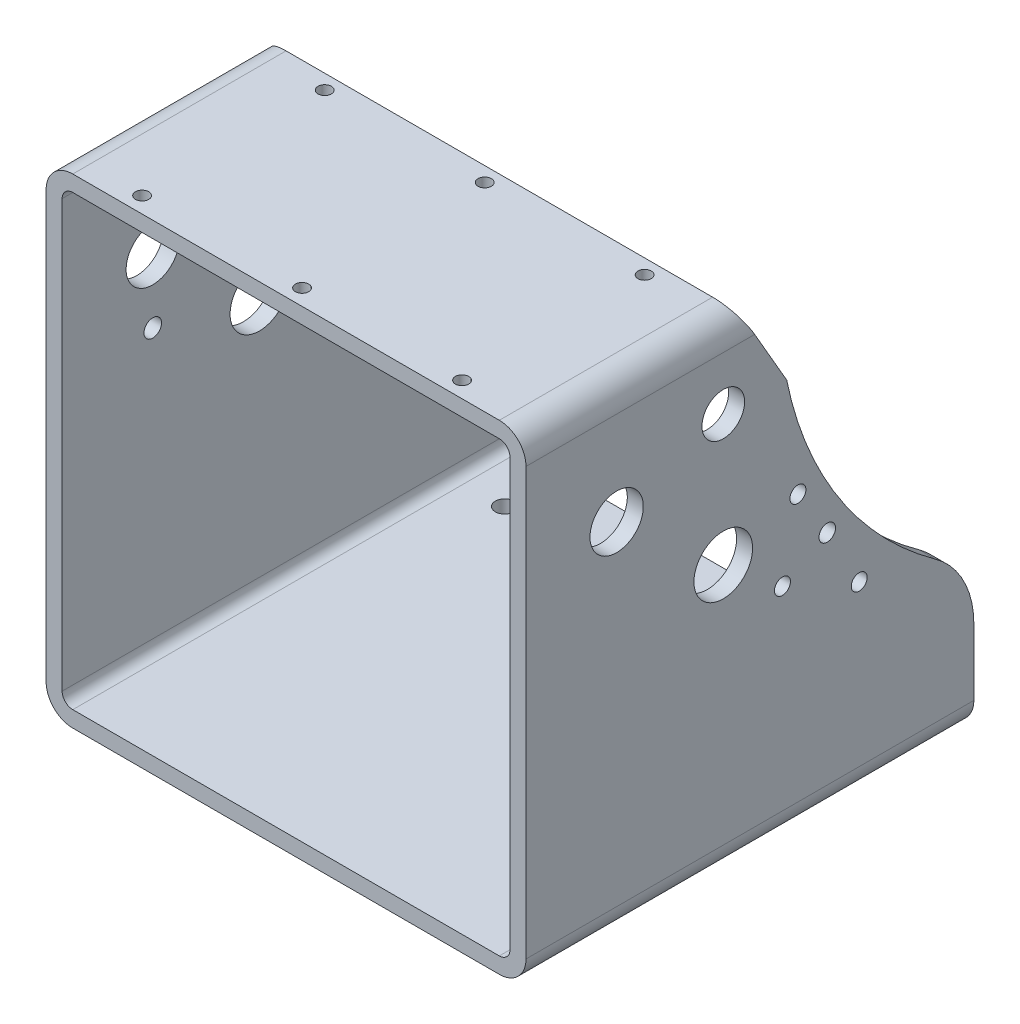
ISO-10303-21;
HEADER;
FILE_DESCRIPTION(('STEP AP214'),'2;1');
FILE_NAME('part.step','',(''),(''),'','','');
FILE_SCHEMA(('AUTOMOTIVE_DESIGN { 1 0 10303 214 1 1 1 1 }'));
ENDSEC;
DATA;
#1=APPLICATION_CONTEXT('core data for automotive mechanical design processes');
#2=APPLICATION_PROTOCOL_DEFINITION('international standard','automotive_design',2000,#1);
#3=PRODUCT_CONTEXT('',#1,'mechanical');
#4=PRODUCT('Part','Part','',(#3));
#5=PRODUCT_RELATED_PRODUCT_CATEGORY('part','',(#4));
#6=PRODUCT_DEFINITION_FORMATION('','',#4);
#7=PRODUCT_DEFINITION_CONTEXT('part definition',#1,'design');
#8=PRODUCT_DEFINITION('design','',#6,#7);
#9=PRODUCT_DEFINITION_SHAPE('','',#8);
#10=(LENGTH_UNIT() NAMED_UNIT(*) SI_UNIT(.MILLI.,.METRE.));
#11=(NAMED_UNIT(*) PLANE_ANGLE_UNIT() SI_UNIT($,.RADIAN.));
#12=(NAMED_UNIT(*) SI_UNIT($,.STERADIAN.) SOLID_ANGLE_UNIT());
#13=UNCERTAINTY_MEASURE_WITH_UNIT(LENGTH_MEASURE(1.E-05),#10,'distance_accuracy_value','');
#14=(GEOMETRIC_REPRESENTATION_CONTEXT(3) GLOBAL_UNCERTAINTY_ASSIGNED_CONTEXT((#13)) GLOBAL_UNIT_ASSIGNED_CONTEXT((#10,
#11,#12)) REPRESENTATION_CONTEXT('',''));
#15=CARTESIAN_POINT('',(0.,0.,0.));
#16=DIRECTION('',(0.,0.,1.));
#17=DIRECTION('',(1.,0.,0.));
#18=AXIS2_PLACEMENT_3D('',#15,#16,#17);
#19=CARTESIAN_POINT('',(75.,8.,-141.));
#20=DIRECTION('',(0.,1.,0.));
#21=DIRECTION('',(1.,0.,0.));
#22=AXIS2_PLACEMENT_3D('',#19,#20,#21);
#23=PLANE('',#22);
#24=DIRECTION('',(0.,0.,1.));
#25=VECTOR('',#24,1.);
#26=CARTESIAN_POINT('',(105.,8.,-144.));
#27=LINE('',#26,#25);
#28=CARTESIAN_POINT('',(105.,8.,-149.));
#29=VERTEX_POINT('',#28);
#30=CARTESIAN_POINT('',(105.,7.99999999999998,-141.));
#31=VERTEX_POINT('',#30);
#32=EDGE_CURVE('E657',#29,#31,#27,.T.);
#33=ORIENTED_EDGE('',*,*,#32,.F.);
#34=DIRECTION('',(1.,0.,0.));
#35=VECTOR('',#34,1.);
#36=CARTESIAN_POINT('',(90.,8.,-149.));
#37=LINE('',#36,#35);
#38=CARTESIAN_POINT('',(75.,8.,-149.));
#39=VERTEX_POINT('',#38);
#40=EDGE_CURVE('E658',#39,#29,#37,.T.);
#41=ORIENTED_EDGE('',*,*,#40,.F.);
#42=DIRECTION('',(0.,0.,-1.));
#43=VECTOR('',#42,1.);
#44=CARTESIAN_POINT('',(75.,8.,-144.));
#45=LINE('',#44,#43);
#46=CARTESIAN_POINT('',(75.,7.99999999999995,-141.));
#47=VERTEX_POINT('',#46);
#48=EDGE_CURVE('E664',#47,#39,#45,.T.);
#49=ORIENTED_EDGE('',*,*,#48,.F.);
#50=DIRECTION('',(-1.,0.,0.));
#51=VECTOR('',#50,1.);
#52=CARTESIAN_POINT('',(90.,7.9999999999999,-141.));
#53=LINE('',#52,#51);
#54=EDGE_CURVE('E674',#31,#47,#53,.T.);
#55=ORIENTED_EDGE('',*,*,#54,.F.);
#56=EDGE_LOOP('',(#33,#41,#49,#55));
#57=FACE_BOUND('',#56,.T.);
#58=ADVANCED_FACE('F15',(#57),#23,.T.);
#59=CARTESIAN_POINT('',(75.,16.,-141.));
#60=DIRECTION('',(0.,0.,-1.));
#61=DIRECTION('',(1.,0.,0.));
#62=AXIS2_PLACEMENT_3D('',#59,#60,#61);
#63=PLANE('',#62);
#64=DIRECTION('',(0.,1.,0.));
#65=VECTOR('',#64,1.);
#66=CARTESIAN_POINT('',(105.,11.,-141.));
#67=LINE('',#66,#65);
#68=CARTESIAN_POINT('',(105.,16.,-141.));
#69=VERTEX_POINT('',#68);
#70=EDGE_CURVE('E650',#31,#69,#67,.T.);
#71=ORIENTED_EDGE('',*,*,#70,.F.);
#72=ORIENTED_EDGE('',*,*,#54,.T.);
#73=DIRECTION('',(0.,-1.,0.));
#74=VECTOR('',#73,1.);
#75=CARTESIAN_POINT('',(75.,11.,-141.));
#76=LINE('',#75,#74);
#77=CARTESIAN_POINT('',(75.,16.,-141.));
#78=VERTEX_POINT('',#77);
#79=EDGE_CURVE('E668',#78,#47,#76,.T.);
#80=ORIENTED_EDGE('',*,*,#79,.F.);
#81=DIRECTION('',(-1.,0.,0.));
#82=VECTOR('',#81,1.);
#83=CARTESIAN_POINT('',(90.,16.,-141.));
#84=LINE('',#83,#82);
#85=EDGE_CURVE('E265',#69,#78,#84,.T.);
#86=ORIENTED_EDGE('',*,*,#85,.F.);
#87=EDGE_LOOP('',(#71,#72,#80,#86));
#88=FACE_BOUND('',#87,.T.);
#89=ADVANCED_FACE('F682',(#88),#63,.T.);
#90=CARTESIAN_POINT('',(75.,16.,-139.));
#91=DIRECTION('',(0.,1.,0.));
#92=DIRECTION('',(1.,0.,0.));
#93=AXIS2_PLACEMENT_3D('',#90,#91,#92);
#94=PLANE('',#93);
#95=DIRECTION('',(0.,0.,1.));
#96=VECTOR('',#95,1.);
#97=CARTESIAN_POINT('',(105.,16.,-144.));
#98=LINE('',#97,#96);
#99=CARTESIAN_POINT('',(105.,16.,-139.));
#100=VERTEX_POINT('',#99);
#101=EDGE_CURVE('E647',#69,#100,#98,.T.);
#102=ORIENTED_EDGE('',*,*,#101,.F.);
#103=ORIENTED_EDGE('',*,*,#85,.T.);
#104=DIRECTION('',(0.,0.,-1.));
#105=VECTOR('',#104,1.);
#106=CARTESIAN_POINT('',(75.,16.,-144.));
#107=LINE('',#106,#105);
#108=CARTESIAN_POINT('',(75.,16.,-139.));
#109=VERTEX_POINT('',#108);
#110=EDGE_CURVE('E264',#109,#78,#107,.T.);
#111=ORIENTED_EDGE('',*,*,#110,.F.);
#112=DIRECTION('',(-1.,0.,0.));
#113=VECTOR('',#112,1.);
#114=CARTESIAN_POINT('',(90.,15.9999999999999,-139.));
#115=LINE('',#114,#113);
#116=EDGE_CURVE('E261',#100,#109,#115,.T.);
#117=ORIENTED_EDGE('',*,*,#116,.F.);
#118=EDGE_LOOP('',(#102,#103,#111,#117));
#119=FACE_BOUND('',#118,.T.);
#120=ADVANCED_FACE('F695',(#119),#94,.T.);
#121=CARTESIAN_POINT('',(180.,177.,-235.));
#122=DIRECTION('',(-1.,0.,0.));
#123=DIRECTION('',(0.,0.,1.));
#124=AXIS2_PLACEMENT_3D('',#121,#122,#123);
#125=CYLINDRICAL_SURFACE('',#124,140.000000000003);
#126=DIRECTION('',(1.,0.,0.));
#127=VECTOR('',#126,1.);
#128=CARTESIAN_POINT('',(90.,149.18528612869,-97.790883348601));
#129=LINE('',#128,#127);
#130=CARTESIAN_POINT('',(174.,149.185286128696,-97.7908833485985));
#131=VERTEX_POINT('',#130);
#132=CARTESIAN_POINT('',(180.,149.185286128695,-97.7908833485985));
#133=VERTEX_POINT('',#132);
#134=EDGE_CURVE('E179',#131,#133,#129,.T.);
#135=ORIENTED_EDGE('',*,*,#134,.T.);
#136=CARTESIAN_POINT('',(180.,177.,-235.));
#137=DIRECTION('',(-1.,0.,0.));
#138=DIRECTION('',(0.,0.,1.));
#139=AXIS2_PLACEMENT_3D('',#136,#137,#138);
#140=CIRCLE('',#139,140.000000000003);
#141=CARTESIAN_POINT('',(180.,63.2395499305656,-153.399999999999));
#142=VERTEX_POINT('',#141);
#143=EDGE_CURVE('E459',#142,#133,#140,.T.);
#144=ORIENTED_EDGE('',*,*,#143,.F.);
#145=DIRECTION('',(-1.,0.,0.));
#146=VECTOR('',#145,1.);
#147=CARTESIAN_POINT('',(90.,63.2395499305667,-153.4));
#148=LINE('',#147,#146);
#149=CARTESIAN_POINT('',(174.,63.2395499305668,-153.4));
#150=VERTEX_POINT('',#149);
#151=EDGE_CURVE('E262',#142,#150,#148,.T.);
#152=ORIENTED_EDGE('',*,*,#151,.T.);
#153=CARTESIAN_POINT('',(174.,177.,-235.));
#154=DIRECTION('',(-1.,0.,0.));
#155=DIRECTION('',(0.,0.,1.));
#156=AXIS2_PLACEMENT_3D('',#153,#154,#155);
#157=CIRCLE('',#156,140.000000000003);
#158=EDGE_CURVE('E419',#131,#150,#157,.F.);
#159=ORIENTED_EDGE('',*,*,#158,.F.);
#160=EDGE_LOOP('',(#135,#144,#152,#159));
#161=FACE_BOUND('',#160,.T.);
#162=ADVANCED_FACE('F562',(#161),#125,.F.);
#163=CARTESIAN_POINT('',(174.000000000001,34.799437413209,-133.));
#164=DIRECTION('',(1.,0.,0.));
#165=DIRECTION('',(0.,1.,0.));
#166=AXIS2_PLACEMENT_3D('',#163,#164,#165);
#167=CYLINDRICAL_SURFACE('',#166,34.9999999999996);
#168=CARTESIAN_POINT('',(174.000000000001,34.799437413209,-133.));
#169=DIRECTION('',(1.,0.,0.));
#170=DIRECTION('',(0.,1.,0.));
#171=AXIS2_PLACEMENT_3D('',#168,#169,#170);
#172=CIRCLE('',#171,34.9999999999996);
#173=CARTESIAN_POINT('',(174.,34.7994374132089,-168.));
#174=VERTEX_POINT('',#173);
#175=EDGE_CURVE('E416',#150,#174,#172,.F.);
#176=ORIENTED_EDGE('',*,*,#175,.F.);
#177=ORIENTED_EDGE('',*,*,#151,.F.);
#178=CARTESIAN_POINT('',(180.,34.799437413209,-133.));
#179=DIRECTION('',(1.,0.,0.));
#180=DIRECTION('',(0.,1.,0.));
#181=AXIS2_PLACEMENT_3D('',#178,#179,#180);
#182=CIRCLE('',#181,34.9999999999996);
#183=CARTESIAN_POINT('',(180.,34.7994374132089,-168.));
#184=VERTEX_POINT('',#183);
#185=EDGE_CURVE('E462',#184,#142,#182,.T.);
#186=ORIENTED_EDGE('',*,*,#185,.F.);
#187=DIRECTION('',(1.,0.,0.));
#188=VECTOR('',#187,1.);
#189=CARTESIAN_POINT('',(90.,34.7994374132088,-168.));
#190=LINE('',#189,#188);
#191=EDGE_CURVE('E257',#174,#184,#190,.T.);
#192=ORIENTED_EDGE('',*,*,#191,.F.);
#193=EDGE_LOOP('',(#176,#177,#186,#192));
#194=FACE_BOUND('',#193,.T.);
#195=ADVANCED_FACE('F857',(#194),#167,.T.);
#196=CARTESIAN_POINT('',(180.,101.,-74.));
#197=DIRECTION('',(-1.,0.,0.));
#198=DIRECTION('',(0.,0.,1.));
#199=AXIS2_PLACEMENT_3D('',#196,#197,#198);
#200=CYLINDRICAL_SURFACE('',#199,11.);
#201=CARTESIAN_POINT('',(174.,101.,-74.));
#202=DIRECTION('',(-1.,0.,0.));
#203=DIRECTION('',(0.,0.,1.));
#204=AXIS2_PLACEMENT_3D('',#201,#202,#203);
#205=CIRCLE('',#204,11.);
#206=CARTESIAN_POINT('',(174.,101.,-63.));
#207=VERTEX_POINT('',#206);
#208=EDGE_CURVE('E408',#207,#207,#205,.F.);
#209=ORIENTED_EDGE('',*,*,#208,.F.);
#210=EDGE_LOOP('',(#209));
#211=FACE_BOUND('',#210,.T.);
#212=CARTESIAN_POINT('',(180.,101.,-74.));
#213=DIRECTION('',(-1.,0.,0.));
#214=DIRECTION('',(0.,0.,1.));
#215=AXIS2_PLACEMENT_3D('',#212,#213,#214);
#216=CIRCLE('',#215,11.);
#217=CARTESIAN_POINT('',(180.,101.,-63.));
#218=VERTEX_POINT('',#217);
#219=EDGE_CURVE('E229',#218,#218,#216,.T.);
#220=ORIENTED_EDGE('',*,*,#219,.F.);
#221=EDGE_LOOP('',(#220));
#222=FACE_BOUND('',#221,.T.);
#223=ADVANCED_FACE('F859',(#211,#222),#200,.F.);
#224=CARTESIAN_POINT('',(180.,150.,-74.));
#225=DIRECTION('',(-1.,0.,0.));
#226=DIRECTION('',(0.,0.,1.));
#227=AXIS2_PLACEMENT_3D('',#224,#225,#226);
#228=CYLINDRICAL_SURFACE('',#227,8.00000000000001);
#229=CARTESIAN_POINT('',(174.,150.,-74.));
#230=DIRECTION('',(-1.,0.,0.));
#231=DIRECTION('',(0.,0.,1.));
#232=AXIS2_PLACEMENT_3D('',#229,#230,#231);
#233=CIRCLE('',#232,8.00000000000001);
#234=CARTESIAN_POINT('',(174.,150.,-66.));
#235=VERTEX_POINT('',#234);
#236=EDGE_CURVE('E403',#235,#235,#233,.F.);
#237=ORIENTED_EDGE('',*,*,#236,.F.);
#238=EDGE_LOOP('',(#237));
#239=FACE_BOUND('',#238,.T.);
#240=CARTESIAN_POINT('',(180.,150.,-74.));
#241=DIRECTION('',(-1.,0.,0.));
#242=DIRECTION('',(0.,0.,1.));
#243=AXIS2_PLACEMENT_3D('',#240,#241,#242);
#244=CIRCLE('',#243,8.00000000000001);
#245=CARTESIAN_POINT('',(180.,150.,-66.));
#246=VERTEX_POINT('',#245);
#247=EDGE_CURVE('E446',#246,#246,#244,.T.);
#248=ORIENTED_EDGE('',*,*,#247,.F.);
#249=EDGE_LOOP('',(#248));
#250=FACE_BOUND('',#249,.T.);
#251=ADVANCED_FACE('F865',(#239,#250),#228,.F.);
#252=CARTESIAN_POINT('',(180.,135.,-34.));
#253=DIRECTION('',(-1.,0.,0.));
#254=DIRECTION('',(0.,0.,1.));
#255=AXIS2_PLACEMENT_3D('',#252,#253,#254);
#256=CYLINDRICAL_SURFACE('',#255,9.99999999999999);
#257=CARTESIAN_POINT('',(174.,135.,-34.));
#258=DIRECTION('',(-1.,0.,0.));
#259=DIRECTION('',(0.,0.,1.));
#260=AXIS2_PLACEMENT_3D('',#257,#258,#259);
#261=CIRCLE('',#260,9.99999999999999);
#262=CARTESIAN_POINT('',(174.,135.,-24.));
#263=VERTEX_POINT('',#262);
#264=EDGE_CURVE('E398',#263,#263,#261,.F.);
#265=ORIENTED_EDGE('',*,*,#264,.F.);
#266=EDGE_LOOP('',(#265));
#267=FACE_BOUND('',#266,.T.);
#268=CARTESIAN_POINT('',(180.,135.,-34.));
#269=DIRECTION('',(-1.,0.,0.));
#270=DIRECTION('',(0.,0.,1.));
#271=AXIS2_PLACEMENT_3D('',#268,#269,#270);
#272=CIRCLE('',#271,9.99999999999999);
#273=CARTESIAN_POINT('',(180.,135.,-24.));
#274=VERTEX_POINT('',#273);
#275=EDGE_CURVE('E441',#274,#274,#272,.T.);
#276=ORIENTED_EDGE('',*,*,#275,.F.);
#277=EDGE_LOOP('',(#276));
#278=FACE_BOUND('',#277,.T.);
#279=ADVANCED_FACE('F872',(#267,#278),#256,.F.);
#280=CARTESIAN_POINT('',(180.,70.,-125.));
#281=DIRECTION('',(-1.,0.,0.));
#282=DIRECTION('',(0.,0.,1.));
#283=AXIS2_PLACEMENT_3D('',#280,#281,#282);
#284=CYLINDRICAL_SURFACE('',#283,3.);
#285=CARTESIAN_POINT('',(174.,70.,-125.));
#286=DIRECTION('',(-1.,0.,0.));
#287=DIRECTION('',(0.,0.,1.));
#288=AXIS2_PLACEMENT_3D('',#285,#286,#287);
#289=CIRCLE('',#288,3.);
#290=CARTESIAN_POINT('',(174.,70.,-122.));
#291=VERTEX_POINT('',#290);
#292=EDGE_CURVE('E393',#291,#291,#289,.F.);
#293=ORIENTED_EDGE('',*,*,#292,.F.);
#294=EDGE_LOOP('',(#293));
#295=FACE_BOUND('',#294,.T.);
#296=CARTESIAN_POINT('',(180.,70.,-125.));
#297=DIRECTION('',(-1.,0.,0.));
#298=DIRECTION('',(0.,0.,1.));
#299=AXIS2_PLACEMENT_3D('',#296,#297,#298);
#300=CIRCLE('',#299,3.);
#301=CARTESIAN_POINT('',(180.,70.,-122.));
#302=VERTEX_POINT('',#301);
#303=EDGE_CURVE('E436',#302,#302,#300,.T.);
#304=ORIENTED_EDGE('',*,*,#303,.F.);
#305=EDGE_LOOP('',(#304));
#306=FACE_BOUND('',#305,.T.);
#307=ADVANCED_FACE('F876',(#295,#306),#284,.F.);
#308=CARTESIAN_POINT('',(180.,110.,-102.));
#309=DIRECTION('',(-1.,0.,0.));
#310=DIRECTION('',(0.,0.,1.));
#311=AXIS2_PLACEMENT_3D('',#308,#309,#310);
#312=CYLINDRICAL_SURFACE('',#311,2.99999999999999);
#313=CARTESIAN_POINT('',(174.,110.,-102.));
#314=DIRECTION('',(-1.,0.,0.));
#315=DIRECTION('',(0.,0.,1.));
#316=AXIS2_PLACEMENT_3D('',#313,#314,#315);
#317=CIRCLE('',#316,2.99999999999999);
#318=CARTESIAN_POINT('',(174.,110.,-99.));
#319=VERTEX_POINT('',#318);
#320=EDGE_CURVE('E388',#319,#319,#317,.F.);
#321=ORIENTED_EDGE('',*,*,#320,.F.);
#322=EDGE_LOOP('',(#321));
#323=FACE_BOUND('',#322,.T.);
#324=CARTESIAN_POINT('',(180.,110.,-102.));
#325=DIRECTION('',(-1.,0.,0.));
#326=DIRECTION('',(0.,0.,1.));
#327=AXIS2_PLACEMENT_3D('',#324,#325,#326);
#328=CIRCLE('',#327,2.99999999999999);
#329=CARTESIAN_POINT('',(180.,110.,-99.));
#330=VERTEX_POINT('',#329);
#331=EDGE_CURVE('E431',#330,#330,#328,.T.);
#332=ORIENTED_EDGE('',*,*,#331,.F.);
#333=EDGE_LOOP('',(#332));
#334=FACE_BOUND('',#333,.T.);
#335=ADVANCED_FACE('F880',(#323,#334),#312,.F.);
#336=CARTESIAN_POINT('',(174.,83.,-96.2));
#337=DIRECTION('',(1.,0.,0.));
#338=DIRECTION('',(0.,0.,-1.));
#339=AXIS2_PLACEMENT_3D('',#336,#337,#338);
#340=CYLINDRICAL_SURFACE('',#339,3.);
#341=CARTESIAN_POINT('',(174.,83.,-96.2));
#342=DIRECTION('',(1.,0.,0.));
#343=DIRECTION('',(0.,0.,-1.));
#344=AXIS2_PLACEMENT_3D('',#341,#342,#343);
#345=CIRCLE('',#344,3.);
#346=CARTESIAN_POINT('',(174.,83.,-99.2));
#347=VERTEX_POINT('',#346);
#348=EDGE_CURVE('E383',#347,#347,#345,.T.);
#349=ORIENTED_EDGE('',*,*,#348,.F.);
#350=EDGE_LOOP('',(#349));
#351=FACE_BOUND('',#350,.T.);
#352=CARTESIAN_POINT('',(180.,83.,-96.2));
#353=DIRECTION('',(1.,0.,0.));
#354=DIRECTION('',(0.,0.,-1.));
#355=AXIS2_PLACEMENT_3D('',#352,#353,#354);
#356=CIRCLE('',#355,3.);
#357=CARTESIAN_POINT('',(180.,83.,-99.2));
#358=VERTEX_POINT('',#357);
#359=EDGE_CURVE('E426',#358,#358,#356,.F.);
#360=ORIENTED_EDGE('',*,*,#359,.F.);
#361=EDGE_LOOP('',(#360));
#362=FACE_BOUND('',#361,.T.);
#363=ADVANCED_FACE('F884',(#351,#362),#340,.F.);
#364=CARTESIAN_POINT('',(180.,92.,-113.));
#365=DIRECTION('',(-1.,0.,0.));
#366=DIRECTION('',(0.,0.,1.));
#367=AXIS2_PLACEMENT_3D('',#364,#365,#366);
#368=CYLINDRICAL_SURFACE('',#367,3.09999999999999);
#369=CARTESIAN_POINT('',(174.,92.,-113.));
#370=DIRECTION('',(-1.,0.,0.));
#371=DIRECTION('',(0.,0.,1.));
#372=AXIS2_PLACEMENT_3D('',#369,#370,#371);
#373=CIRCLE('',#372,3.09999999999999);
#374=CARTESIAN_POINT('',(174.,92.,-109.9));
#375=VERTEX_POINT('',#374);
#376=EDGE_CURVE('E220',#375,#375,#373,.F.);
#377=ORIENTED_EDGE('',*,*,#376,.F.);
#378=EDGE_LOOP('',(#377));
#379=FACE_BOUND('',#378,.T.);
#380=CARTESIAN_POINT('',(180.,92.,-113.));
#381=DIRECTION('',(-1.,0.,0.));
#382=DIRECTION('',(0.,0.,1.));
#383=AXIS2_PLACEMENT_3D('',#380,#381,#382);
#384=CIRCLE('',#383,3.09999999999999);
#385=CARTESIAN_POINT('',(180.,92.,-109.9));
#386=VERTEX_POINT('',#385);
#387=EDGE_CURVE('E423',#386,#386,#384,.T.);
#388=ORIENTED_EDGE('',*,*,#387,.F.);
#389=EDGE_LOOP('',(#388));
#390=FACE_BOUND('',#389,.T.);
#391=ADVANCED_FACE('F753',(#379,#390),#368,.F.);
#392=CARTESIAN_POINT('',(155.,6.,-147.));
#393=DIRECTION('',(0.,-1.,0.));
#394=DIRECTION('',(0.,0.,-1.));
#395=AXIS2_PLACEMENT_3D('',#392,#393,#394);
#396=CYLINDRICAL_SURFACE('',#395,3.5);
#397=CARTESIAN_POINT('',(155.,6.,-147.));
#398=DIRECTION('',(0.,-1.,0.));
#399=DIRECTION('',(0.,0.,-1.));
#400=AXIS2_PLACEMENT_3D('',#397,#398,#399);
#401=CIRCLE('',#400,3.5);
#402=CARTESIAN_POINT('',(155.,6.,-150.5));
#403=VERTEX_POINT('',#402);
#404=EDGE_CURVE('E259',#403,#403,#401,.T.);
#405=ORIENTED_EDGE('',*,*,#404,.F.);
#406=EDGE_LOOP('',(#405));
#407=FACE_BOUND('',#406,.T.);
#408=CARTESIAN_POINT('',(155.,0.,-147.));
#409=DIRECTION('',(0.,-1.,0.));
#410=DIRECTION('',(0.,0.,-1.));
#411=AXIS2_PLACEMENT_3D('',#408,#409,#410);
#412=CIRCLE('',#411,3.5);
#413=CARTESIAN_POINT('',(155.,0.,-150.5));
#414=VERTEX_POINT('',#413);
#415=EDGE_CURVE('E269',#414,#414,#412,.F.);
#416=ORIENTED_EDGE('',*,*,#415,.F.);
#417=EDGE_LOOP('',(#416));
#418=FACE_BOUND('',#417,.T.);
#419=ADVANCED_FACE('F747',(#407,#418),#396,.F.);
#420=CARTESIAN_POINT('',(25.,6.,-147.));
#421=DIRECTION('',(0.,-1.,0.));
#422=DIRECTION('',(0.,0.,-1.));
#423=AXIS2_PLACEMENT_3D('',#420,#421,#422);
#424=CYLINDRICAL_SURFACE('',#423,3.5);
#425=CARTESIAN_POINT('',(25.,6.,-147.));
#426=DIRECTION('',(0.,-1.,0.));
#427=DIRECTION('',(0.,0.,-1.));
#428=AXIS2_PLACEMENT_3D('',#425,#426,#427);
#429=CIRCLE('',#428,3.5);
#430=CARTESIAN_POINT('',(25.,6.,-150.5));
#431=VERTEX_POINT('',#430);
#432=EDGE_CURVE('E370',#431,#431,#429,.T.);
#433=ORIENTED_EDGE('',*,*,#432,.F.);
#434=EDGE_LOOP('',(#433));
#435=FACE_BOUND('',#434,.T.);
#436=CARTESIAN_POINT('',(25.,0.,-147.));
#437=DIRECTION('',(0.,-1.,0.));
#438=DIRECTION('',(0.,0.,-1.));
#439=AXIS2_PLACEMENT_3D('',#436,#437,#438);
#440=CIRCLE('',#439,3.5);
#441=CARTESIAN_POINT('',(25.,0.,-150.5));
#442=VERTEX_POINT('',#441);
#443=EDGE_CURVE('E466',#442,#442,#440,.F.);
#444=ORIENTED_EDGE('',*,*,#443,.F.);
#445=EDGE_LOOP('',(#444));
#446=FACE_BOUND('',#445,.T.);
#447=ADVANCED_FACE('F743',(#435,#446),#424,.F.);
#448=CARTESIAN_POINT('',(75.,16.,-139.));
#449=DIRECTION('',(-1.,0.,0.));
#450=DIRECTION('',(0.,0.,-1.));
#451=AXIS2_PLACEMENT_3D('',#448,#449,#450);
#452=PLANE('',#451);
#453=DIRECTION('',(0.,1.,0.));
#454=VECTOR('',#453,1.);
#455=CARTESIAN_POINT('',(75.,-7.,-149.));
#456=LINE('',#455,#454);
#457=CARTESIAN_POINT('',(75.,6.,-149.));
#458=VERTEX_POINT('',#457);
#459=EDGE_CURVE('E641',#458,#39,#456,.T.);
#460=ORIENTED_EDGE('',*,*,#459,.F.);
#461=DIRECTION('',(0.,0.,-1.));
#462=VECTOR('',#461,1.);
#463=CARTESIAN_POINT('',(75.0000000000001,6.,-84.));
#464=LINE('',#463,#462);
#465=CARTESIAN_POINT('',(75.,6.,-139.));
#466=VERTEX_POINT('',#465);
#467=EDGE_CURVE('E373',#466,#458,#464,.T.);
#468=ORIENTED_EDGE('',*,*,#467,.F.);
#469=DIRECTION('',(0.,-1.,0.));
#470=VECTOR('',#469,1.);
#471=CARTESIAN_POINT('',(75.,21.,-139.));
#472=LINE('',#471,#470);
#473=EDGE_CURVE('E637',#109,#466,#472,.T.);
#474=ORIENTED_EDGE('',*,*,#473,.F.);
#475=ORIENTED_EDGE('',*,*,#110,.T.);
#476=ORIENTED_EDGE('',*,*,#79,.T.);
#477=ORIENTED_EDGE('',*,*,#48,.T.);
#478=EDGE_LOOP('',(#460,#468,#474,#475,#476,#477));
#479=FACE_BOUND('',#478,.T.);
#480=ADVANCED_FACE('F634',(#479),#452,.T.);
#481=CARTESIAN_POINT('',(75.,8.,-149.));
#482=DIRECTION('',(0.,0.,-1.));
#483=DIRECTION('',(1.,0.,0.));
#484=AXIS2_PLACEMENT_3D('',#481,#482,#483);
#485=PLANE('',#484);
#486=DIRECTION('',(0.,1.,0.));
#487=VECTOR('',#486,1.);
#488=CARTESIAN_POINT('',(105.,11.,-149.));
#489=LINE('',#488,#487);
#490=CARTESIAN_POINT('',(105.,5.99999999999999,-149.));
#491=VERTEX_POINT('',#490);
#492=EDGE_CURVE('E654',#491,#29,#489,.T.);
#493=ORIENTED_EDGE('',*,*,#492,.F.);
#494=DIRECTION('',(1.,0.,0.));
#495=VECTOR('',#494,1.);
#496=CARTESIAN_POINT('',(86.,6.,-149.));
#497=LINE('',#496,#495);
#498=EDGE_CURVE('E620',#458,#491,#497,.T.);
#499=ORIENTED_EDGE('',*,*,#498,.F.);
#500=ORIENTED_EDGE('',*,*,#459,.T.);
#501=ORIENTED_EDGE('',*,*,#40,.T.);
#502=EDGE_LOOP('',(#493,#499,#500,#501));
#503=FACE_BOUND('',#502,.T.);
#504=ADVANCED_FACE('F707',(#503),#485,.T.);
#505=CARTESIAN_POINT('',(105.,16.,-149.));
#506=DIRECTION('',(1.,0.,0.));
#507=DIRECTION('',(0.,0.,1.));
#508=AXIS2_PLACEMENT_3D('',#505,#506,#507);
#509=PLANE('',#508);
#510=ORIENTED_EDGE('',*,*,#101,.T.);
#511=DIRECTION('',(0.,1.,0.));
#512=VECTOR('',#511,1.);
#513=CARTESIAN_POINT('',(105.,21.,-139.));
#514=LINE('',#513,#512);
#515=CARTESIAN_POINT('',(105.,6.,-139.));
#516=VERTEX_POINT('',#515);
#517=EDGE_CURVE('E646',#516,#100,#514,.T.);
#518=ORIENTED_EDGE('',*,*,#517,.F.);
#519=DIRECTION('',(0.,0.,1.));
#520=VECTOR('',#519,1.);
#521=CARTESIAN_POINT('',(105.,6.,-84.));
#522=LINE('',#521,#520);
#523=EDGE_CURVE('E617',#491,#516,#522,.T.);
#524=ORIENTED_EDGE('',*,*,#523,.F.);
#525=ORIENTED_EDGE('',*,*,#492,.T.);
#526=ORIENTED_EDGE('',*,*,#32,.T.);
#527=ORIENTED_EDGE('',*,*,#70,.T.);
#528=EDGE_LOOP('',(#510,#518,#524,#525,#526,#527));
#529=FACE_BOUND('',#528,.T.);
#530=ADVANCED_FACE('F710',(#529),#509,.T.);
#531=CARTESIAN_POINT('',(75.,6.,-139.));
#532=DIRECTION('',(0.,0.,1.));
#533=DIRECTION('',(1.,0.,0.));
#534=AXIS2_PLACEMENT_3D('',#531,#532,#533);
#535=PLANE('',#534);
#536=ORIENTED_EDGE('',*,*,#517,.T.);
#537=ORIENTED_EDGE('',*,*,#116,.T.);
#538=ORIENTED_EDGE('',*,*,#473,.T.);
#539=DIRECTION('',(-1.,0.,0.));
#540=VECTOR('',#539,1.);
#541=CARTESIAN_POINT('',(86.,6.,-139.));
#542=LINE('',#541,#540);
#543=EDGE_CURVE('E211',#516,#466,#542,.T.);
#544=ORIENTED_EDGE('',*,*,#543,.F.);
#545=EDGE_LOOP('',(#536,#537,#538,#544));
#546=FACE_BOUND('',#545,.T.);
#547=ADVANCED_FACE('F644',(#546),#535,.T.);
#548=CARTESIAN_POINT('',(180.,0.,-168.));
#549=DIRECTION('',(0.,0.,-1.));
#550=DIRECTION('',(-1.,0.,0.));
#551=AXIS2_PLACEMENT_3D('',#548,#549,#550);
#552=PLANE('',#551);
#553=DIRECTION('',(0.,-1.,0.));
#554=VECTOR('',#553,1.);
#555=CARTESIAN_POINT('',(174.,86.,-168.));
#556=LINE('',#555,#554);
#557=CARTESIAN_POINT('',(174.000000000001,10.0000000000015,-168.));
#558=VERTEX_POINT('',#557);
#559=EDGE_CURVE('E413',#174,#558,#556,.T.);
#560=ORIENTED_EDGE('',*,*,#559,.F.);
#561=ORIENTED_EDGE('',*,*,#191,.T.);
#562=DIRECTION('',(0.,1.,0.));
#563=VECTOR('',#562,1.);
#564=CARTESIAN_POINT('',(180.,94.,-168.));
#565=LINE('',#564,#563);
#566=CARTESIAN_POINT('',(180.,9.99999999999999,-168.));
#567=VERTEX_POINT('',#566);
#568=EDGE_CURVE('E224',#567,#184,#565,.T.);
#569=ORIENTED_EDGE('',*,*,#568,.F.);
#570=CARTESIAN_POINT('',(170.,10.,-168.));
#571=DIRECTION('',(0.,0.,1.));
#572=DIRECTION('',(1.,0.,0.));
#573=AXIS2_PLACEMENT_3D('',#570,#571,#572);
#574=CIRCLE('',#573,10.0000000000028);
#575=CARTESIAN_POINT('',(170.000000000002,-1.42247325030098E-12,-168.));
#576=VERTEX_POINT('',#575);
#577=EDGE_CURVE('E232',#567,#576,#574,.F.);
#578=ORIENTED_EDGE('',*,*,#577,.T.);
#579=DIRECTION('',(1.,0.,0.));
#580=VECTOR('',#579,1.);
#581=CARTESIAN_POINT('',(94.,0.,-168.));
#582=LINE('',#581,#580);
#583=CARTESIAN_POINT('',(9.99999999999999,0.,-168.));
#584=VERTEX_POINT('',#583);
#585=EDGE_CURVE('E236',#584,#576,#582,.T.);
#586=ORIENTED_EDGE('',*,*,#585,.F.);
#587=CARTESIAN_POINT('',(10.,10.,-168.));
#588=DIRECTION('',(0.,0.,1.));
#589=DIRECTION('',(1.,0.,0.));
#590=AXIS2_PLACEMENT_3D('',#587,#588,#589);
#591=CIRCLE('',#590,9.99999999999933);
#592=CARTESIAN_POINT('',(3.36536354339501E-13,10.0000000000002,-168.));
#593=VERTEX_POINT('',#592);
#594=EDGE_CURVE('E239',#584,#593,#591,.F.);
#595=ORIENTED_EDGE('',*,*,#594,.T.);
#596=DIRECTION('',(0.,-1.,0.));
#597=VECTOR('',#596,1.);
#598=CARTESIAN_POINT('',(0.,86.,-168.));
#599=LINE('',#598,#597);
#600=CARTESIAN_POINT('',(0.,34.79943741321,-168.));
#601=VERTEX_POINT('',#600);
#602=EDGE_CURVE('E509',#601,#593,#599,.T.);
#603=ORIENTED_EDGE('',*,*,#602,.F.);
#604=DIRECTION('',(1.,0.,0.));
#605=VECTOR('',#604,1.);
#606=CARTESIAN_POINT('',(90.,34.7994374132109,-168.));
#607=LINE('',#606,#605);
#608=CARTESIAN_POINT('',(5.99999999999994,34.79943741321,-168.));
#609=VERTEX_POINT('',#608);
#610=EDGE_CURVE('E255',#601,#609,#607,.T.);
#611=ORIENTED_EDGE('',*,*,#610,.T.);
#612=DIRECTION('',(0.,1.,0.));
#613=VECTOR('',#612,1.);
#614=CARTESIAN_POINT('',(6.,94.,-168.));
#615=LINE('',#614,#613);
#616=CARTESIAN_POINT('',(6.,9.99999999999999,-168.));
#617=VERTEX_POINT('',#616);
#618=EDGE_CURVE('E206',#617,#609,#615,.T.);
#619=ORIENTED_EDGE('',*,*,#618,.F.);
#620=CARTESIAN_POINT('',(10.,10.,-168.));
#621=DIRECTION('',(0.,0.,-1.));
#622=DIRECTION('',(-1.,0.,0.));
#623=AXIS2_PLACEMENT_3D('',#620,#621,#622);
#624=CIRCLE('',#623,3.99999999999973);
#625=CARTESIAN_POINT('',(10.0000000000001,6.00000000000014,-168.));
#626=VERTEX_POINT('',#625);
#627=EDGE_CURVE('E207',#626,#617,#624,.T.);
#628=ORIENTED_EDGE('',*,*,#627,.F.);
#629=DIRECTION('',(-1.,0.,0.));
#630=VECTOR('',#629,1.);
#631=CARTESIAN_POINT('',(86.,6.,-168.));
#632=LINE('',#631,#630);
#633=CARTESIAN_POINT('',(170.,6.,-168.));
#634=VERTEX_POINT('',#633);
#635=EDGE_CURVE('E215',#634,#626,#632,.T.);
#636=ORIENTED_EDGE('',*,*,#635,.F.);
#637=CARTESIAN_POINT('',(170.,10.,-168.));
#638=DIRECTION('',(0.,0.,-1.));
#639=DIRECTION('',(-1.,0.,0.));
#640=AXIS2_PLACEMENT_3D('',#637,#638,#639);
#641=CIRCLE('',#640,4.00000000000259);
#642=EDGE_CURVE('E216',#558,#634,#641,.T.);
#643=ORIENTED_EDGE('',*,*,#642,.F.);
#644=EDGE_LOOP('',(#560,#561,#569,#578,#586,#595,#603,#611,#619,#628,#636,#643));
#645=FACE_BOUND('',#644,.T.);
#646=ADVANCED_FACE('F720',(#645),#552,.T.);
#647=CARTESIAN_POINT('',(0.,34.799437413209,-133.));
#648=DIRECTION('',(1.,0.,0.));
#649=DIRECTION('',(0.,0.,-1.));
#650=AXIS2_PLACEMENT_3D('',#647,#648,#649);
#651=CYLINDRICAL_SURFACE('',#650,34.9999999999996);
#652=DIRECTION('',(-1.,0.,0.));
#653=VECTOR('',#652,1.);
#654=CARTESIAN_POINT('',(90.,63.23954993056,-153.400000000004));
#655=LINE('',#654,#653);
#656=CARTESIAN_POINT('',(5.9999999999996,63.2395499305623,-153.400000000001));
#657=VERTEX_POINT('',#656);
#658=CARTESIAN_POINT('',(0.,63.2395499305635,-153.400000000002));
#659=VERTEX_POINT('',#658);
#660=EDGE_CURVE('E253',#657,#659,#655,.T.);
#661=ORIENTED_EDGE('',*,*,#660,.F.);
#662=CARTESIAN_POINT('',(5.99999999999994,34.799437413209,-133.));
#663=DIRECTION('',(1.,0.,0.));
#664=DIRECTION('',(0.,0.,-1.));
#665=AXIS2_PLACEMENT_3D('',#662,#663,#664);
#666=CIRCLE('',#665,34.9999999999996);
#667=EDGE_CURVE('E366',#609,#657,#666,.T.);
#668=ORIENTED_EDGE('',*,*,#667,.F.);
#669=ORIENTED_EDGE('',*,*,#610,.F.);
#670=CARTESIAN_POINT('',(0.,34.799437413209,-133.));
#671=DIRECTION('',(1.,0.,0.));
#672=DIRECTION('',(0.,0.,-1.));
#673=AXIS2_PLACEMENT_3D('',#670,#671,#672);
#674=CIRCLE('',#673,34.9999999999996);
#675=EDGE_CURVE('E512',#659,#601,#674,.F.);
#676=ORIENTED_EDGE('',*,*,#675,.F.);
#677=EDGE_LOOP('',(#661,#668,#669,#676));
#678=FACE_BOUND('',#677,.T.);
#679=ADVANCED_FACE('F760',(#678),#651,.T.);
#680=CARTESIAN_POINT('',(5.99999999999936,177.,-235.));
#681=DIRECTION('',(-1.,0.,0.));
#682=DIRECTION('',(0.,-1.,0.));
#683=AXIS2_PLACEMENT_3D('',#680,#681,#682);
#684=CYLINDRICAL_SURFACE('',#683,140.000000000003);
#685=CARTESIAN_POINT('',(5.99999999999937,177.,-235.));
#686=DIRECTION('',(-1.,0.,0.));
#687=DIRECTION('',(0.,-1.,0.));
#688=AXIS2_PLACEMENT_3D('',#685,#686,#687);
#689=CIRCLE('',#688,140.000000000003);
#690=CARTESIAN_POINT('',(5.99999999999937,149.185286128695,-97.7908833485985));
#691=VERTEX_POINT('',#690);
#692=EDGE_CURVE('E363',#657,#691,#689,.T.);
#693=ORIENTED_EDGE('',*,*,#692,.F.);
#694=ORIENTED_EDGE('',*,*,#660,.T.);
#695=CARTESIAN_POINT('',(0.,177.,-235.));
#696=DIRECTION('',(-1.,0.,0.));
#697=DIRECTION('',(0.,-1.,0.));
#698=AXIS2_PLACEMENT_3D('',#695,#696,#697);
#699=CIRCLE('',#698,140.000000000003);
#700=CARTESIAN_POINT('',(0.,149.185286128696,-97.7908833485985));
#701=VERTEX_POINT('',#700);
#702=EDGE_CURVE('E515',#701,#659,#699,.F.);
#703=ORIENTED_EDGE('',*,*,#702,.F.);
#704=DIRECTION('',(1.,0.,0.));
#705=VECTOR('',#704,1.);
#706=CARTESIAN_POINT('',(90.,149.18528612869,-97.790883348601));
#707=LINE('',#706,#705);
#708=EDGE_CURVE('E180',#701,#691,#707,.T.);
#709=ORIENTED_EDGE('',*,*,#708,.T.);
#710=EDGE_LOOP('',(#693,#694,#703,#709));
#711=FACE_BOUND('',#710,.T.);
#712=ADVANCED_FACE('F763',(#711),#684,.F.);
#713=CARTESIAN_POINT('',(5.99999999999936,101.,-74.));
#714=DIRECTION('',(-1.,0.,0.));
#715=DIRECTION('',(0.,-1.,0.));
#716=AXIS2_PLACEMENT_3D('',#713,#714,#715);
#717=CYLINDRICAL_SURFACE('',#716,11.);
#718=CARTESIAN_POINT('',(5.99999999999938,101.,-74.));
#719=DIRECTION('',(-1.,0.,0.));
#720=DIRECTION('',(0.,-1.,0.));
#721=AXIS2_PLACEMENT_3D('',#718,#719,#720);
#722=CIRCLE('',#721,11.);
#723=CARTESIAN_POINT('',(5.99999999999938,90.,-74.));
#724=VERTEX_POINT('',#723);
#725=EDGE_CURVE('E353',#724,#724,#722,.T.);
#726=ORIENTED_EDGE('',*,*,#725,.F.);
#727=EDGE_LOOP('',(#726));
#728=FACE_BOUND('',#727,.T.);
#729=CARTESIAN_POINT('',(0.,101.,-74.));
#730=DIRECTION('',(-1.,0.,0.));
#731=DIRECTION('',(0.,-1.,0.));
#732=AXIS2_PLACEMENT_3D('',#729,#730,#731);
#733=CIRCLE('',#732,11.);
#734=CARTESIAN_POINT('',(0.,90.,-74.));
#735=VERTEX_POINT('',#734);
#736=EDGE_CURVE('E504',#735,#735,#733,.F.);
#737=ORIENTED_EDGE('',*,*,#736,.F.);
#738=EDGE_LOOP('',(#737));
#739=FACE_BOUND('',#738,.T.);
#740=ADVANCED_FACE('F767',(#728,#739),#717,.F.);
#741=CARTESIAN_POINT('',(5.99999999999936,150.,-74.));
#742=DIRECTION('',(-1.,0.,0.));
#743=DIRECTION('',(0.,-1.,0.));
#744=AXIS2_PLACEMENT_3D('',#741,#742,#743);
#745=CYLINDRICAL_SURFACE('',#744,8.00000000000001);
#746=CARTESIAN_POINT('',(5.99999999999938,150.,-74.));
#747=DIRECTION('',(-1.,0.,0.));
#748=DIRECTION('',(0.,-1.,0.));
#749=AXIS2_PLACEMENT_3D('',#746,#747,#748);
#750=CIRCLE('',#749,8.00000000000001);
#751=CARTESIAN_POINT('',(5.99999999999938,142.,-74.));
#752=VERTEX_POINT('',#751);
#753=EDGE_CURVE('E348',#752,#752,#750,.T.);
#754=ORIENTED_EDGE('',*,*,#753,.F.);
#755=EDGE_LOOP('',(#754));
#756=FACE_BOUND('',#755,.T.);
#757=CARTESIAN_POINT('',(0.,150.,-74.));
#758=DIRECTION('',(-1.,0.,0.));
#759=DIRECTION('',(0.,-1.,0.));
#760=AXIS2_PLACEMENT_3D('',#757,#758,#759);
#761=CIRCLE('',#760,8.00000000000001);
#762=CARTESIAN_POINT('',(0.,142.,-74.));
#763=VERTEX_POINT('',#762);
#764=EDGE_CURVE('E499',#763,#763,#761,.F.);
#765=ORIENTED_EDGE('',*,*,#764,.F.);
#766=EDGE_LOOP('',(#765));
#767=FACE_BOUND('',#766,.T.);
#768=ADVANCED_FACE('F771',(#756,#767),#745,.F.);
#769=CARTESIAN_POINT('',(5.99999999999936,135.,-34.));
#770=DIRECTION('',(-1.,0.,0.));
#771=DIRECTION('',(0.,-1.,0.));
#772=AXIS2_PLACEMENT_3D('',#769,#770,#771);
#773=CYLINDRICAL_SURFACE('',#772,9.99999999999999);
#774=CARTESIAN_POINT('',(5.99999999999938,135.,-34.));
#775=DIRECTION('',(-1.,0.,0.));
#776=DIRECTION('',(0.,-1.,0.));
#777=AXIS2_PLACEMENT_3D('',#774,#775,#776);
#778=CIRCLE('',#777,9.99999999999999);
#779=CARTESIAN_POINT('',(5.99999999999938,125.,-34.));
#780=VERTEX_POINT('',#779);
#781=EDGE_CURVE('E343',#780,#780,#778,.T.);
#782=ORIENTED_EDGE('',*,*,#781,.F.);
#783=EDGE_LOOP('',(#782));
#784=FACE_BOUND('',#783,.T.);
#785=CARTESIAN_POINT('',(0.,135.,-34.));
#786=DIRECTION('',(-1.,0.,0.));
#787=DIRECTION('',(0.,-1.,0.));
#788=AXIS2_PLACEMENT_3D('',#785,#786,#787);
#789=CIRCLE('',#788,9.99999999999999);
#790=CARTESIAN_POINT('',(0.,125.,-34.));
#791=VERTEX_POINT('',#790);
#792=EDGE_CURVE('E494',#791,#791,#789,.F.);
#793=ORIENTED_EDGE('',*,*,#792,.F.);
#794=EDGE_LOOP('',(#793));
#795=FACE_BOUND('',#794,.T.);
#796=ADVANCED_FACE('F775',(#784,#795),#773,.F.);
#797=CARTESIAN_POINT('',(5.99999999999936,70.,-125.));
#798=DIRECTION('',(-1.,0.,0.));
#799=DIRECTION('',(0.,-1.,0.));
#800=AXIS2_PLACEMENT_3D('',#797,#798,#799);
#801=CYLINDRICAL_SURFACE('',#800,3.);
#802=CARTESIAN_POINT('',(5.99999999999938,70.,-125.));
#803=DIRECTION('',(-1.,0.,0.));
#804=DIRECTION('',(0.,-1.,0.));
#805=AXIS2_PLACEMENT_3D('',#802,#803,#804);
#806=CIRCLE('',#805,3.);
#807=CARTESIAN_POINT('',(5.99999999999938,67.,-125.));
#808=VERTEX_POINT('',#807);
#809=EDGE_CURVE('E338',#808,#808,#806,.T.);
#810=ORIENTED_EDGE('',*,*,#809,.F.);
#811=EDGE_LOOP('',(#810));
#812=FACE_BOUND('',#811,.T.);
#813=CARTESIAN_POINT('',(0.,70.,-125.));
#814=DIRECTION('',(-1.,0.,0.));
#815=DIRECTION('',(0.,-1.,0.));
#816=AXIS2_PLACEMENT_3D('',#813,#814,#815);
#817=CIRCLE('',#816,3.);
#818=CARTESIAN_POINT('',(0.,67.,-125.));
#819=VERTEX_POINT('',#818);
#820=EDGE_CURVE('E489',#819,#819,#817,.F.);
#821=ORIENTED_EDGE('',*,*,#820,.F.);
#822=EDGE_LOOP('',(#821));
#823=FACE_BOUND('',#822,.T.);
#824=ADVANCED_FACE('F779',(#812,#823),#801,.F.);
#825=CARTESIAN_POINT('',(5.99999999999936,110.,-102.));
#826=DIRECTION('',(-1.,0.,0.));
#827=DIRECTION('',(0.,-1.,0.));
#828=AXIS2_PLACEMENT_3D('',#825,#826,#827);
#829=CYLINDRICAL_SURFACE('',#828,2.99999999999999);
#830=CARTESIAN_POINT('',(5.99999999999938,110.,-102.));
#831=DIRECTION('',(-1.,0.,0.));
#832=DIRECTION('',(0.,-1.,0.));
#833=AXIS2_PLACEMENT_3D('',#830,#831,#832);
#834=CIRCLE('',#833,2.99999999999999);
#835=CARTESIAN_POINT('',(5.99999999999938,107.,-102.));
#836=VERTEX_POINT('',#835);
#837=EDGE_CURVE('E333',#836,#836,#834,.T.);
#838=ORIENTED_EDGE('',*,*,#837,.F.);
#839=EDGE_LOOP('',(#838));
#840=FACE_BOUND('',#839,.T.);
#841=CARTESIAN_POINT('',(0.,110.,-102.));
#842=DIRECTION('',(-1.,0.,0.));
#843=DIRECTION('',(0.,-1.,0.));
#844=AXIS2_PLACEMENT_3D('',#841,#842,#843);
#845=CIRCLE('',#844,2.99999999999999);
#846=CARTESIAN_POINT('',(0.,107.,-102.));
#847=VERTEX_POINT('',#846);
#848=EDGE_CURVE('E484',#847,#847,#845,.F.);
#849=ORIENTED_EDGE('',*,*,#848,.F.);
#850=EDGE_LOOP('',(#849));
#851=FACE_BOUND('',#850,.T.);
#852=ADVANCED_FACE('F783',(#840,#851),#829,.F.);
#853=CARTESIAN_POINT('',(5.99999999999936,92.,-113.));
#854=DIRECTION('',(-1.,0.,0.));
#855=DIRECTION('',(0.,-1.,0.));
#856=AXIS2_PLACEMENT_3D('',#853,#854,#855);
#857=CYLINDRICAL_SURFACE('',#856,3.09999999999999);
#858=CARTESIAN_POINT('',(5.99999999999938,92.,-113.));
#859=DIRECTION('',(-1.,0.,0.));
#860=DIRECTION('',(0.,-1.,0.));
#861=AXIS2_PLACEMENT_3D('',#858,#859,#860);
#862=CIRCLE('',#861,3.09999999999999);
#863=CARTESIAN_POINT('',(5.99999999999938,88.9,-113.));
#864=VERTEX_POINT('',#863);
#865=EDGE_CURVE('E328',#864,#864,#862,.T.);
#866=ORIENTED_EDGE('',*,*,#865,.F.);
#867=EDGE_LOOP('',(#866));
#868=FACE_BOUND('',#867,.T.);
#869=CARTESIAN_POINT('',(0.,92.,-113.));
#870=DIRECTION('',(-1.,0.,0.));
#871=DIRECTION('',(0.,-1.,0.));
#872=AXIS2_PLACEMENT_3D('',#869,#870,#871);
#873=CIRCLE('',#872,3.09999999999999);
#874=CARTESIAN_POINT('',(0.,88.9,-113.));
#875=VERTEX_POINT('',#874);
#876=EDGE_CURVE('E479',#875,#875,#873,.F.);
#877=ORIENTED_EDGE('',*,*,#876,.F.);
#878=EDGE_LOOP('',(#877));
#879=FACE_BOUND('',#878,.T.);
#880=ADVANCED_FACE('F787',(#868,#879),#857,.F.);
#881=CARTESIAN_POINT('',(6.,111.,-34.));
#882=DIRECTION('',(-1.,0.,0.));
#883=DIRECTION('',(0.,0.,1.));
#884=AXIS2_PLACEMENT_3D('',#881,#882,#883);
#885=CYLINDRICAL_SURFACE('',#884,3.3);
#886=CARTESIAN_POINT('',(6.,111.,-34.));
#887=DIRECTION('',(-1.,0.,0.));
#888=DIRECTION('',(0.,0.,1.));
#889=AXIS2_PLACEMENT_3D('',#886,#887,#888);
#890=CIRCLE('',#889,3.3);
#891=CARTESIAN_POINT('',(6.,111.,-30.7));
#892=VERTEX_POINT('',#891);
#893=EDGE_CURVE('E202',#892,#892,#890,.T.);
#894=ORIENTED_EDGE('',*,*,#893,.F.);
#895=EDGE_LOOP('',(#894));
#896=FACE_BOUND('',#895,.T.);
#897=CARTESIAN_POINT('',(0.,111.,-34.));
#898=DIRECTION('',(-1.,0.,0.));
#899=DIRECTION('',(0.,0.,1.));
#900=AXIS2_PLACEMENT_3D('',#897,#898,#899);
#901=CIRCLE('',#900,3.3);
#902=CARTESIAN_POINT('',(0.,111.,-30.7));
#903=VERTEX_POINT('',#902);
#904=EDGE_CURVE('E476',#903,#903,#901,.F.);
#905=ORIENTED_EDGE('',*,*,#904,.F.);
#906=EDGE_LOOP('',(#905));
#907=FACE_BOUND('',#906,.T.);
#908=ADVANCED_FACE('F791',(#896,#907),#885,.F.);
#909=CARTESIAN_POINT('',(0.,149.18528612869,-97.790883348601));
#910=DIRECTION('',(0.,-0.499999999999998,0.86602540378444));
#911=DIRECTION('',(1.,0.,0.));
#912=AXIS2_PLACEMENT_3D('',#909,#910,#911);
#913=PLANE('',#912);
#914=DIRECTION('',(0.,-0.866025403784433,-0.500000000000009));
#915=VECTOR('',#914,1.);
#916=CARTESIAN_POINT('',(0.,170.,-85.7735026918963));
#917=LINE('',#916,#915);
#918=CARTESIAN_POINT('',(-1.42247325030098E-12,170.,-85.7735026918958));
#919=VERTEX_POINT('',#918);
#920=EDGE_CURVE('E243',#919,#701,#917,.T.);
#921=ORIENTED_EDGE('',*,*,#920,.F.);
#922=CARTESIAN_POINT('',(10.,170.,-85.7735026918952));
#923=DIRECTION('',(0.,-0.499999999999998,0.86602540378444));
#924=DIRECTION('',(0.,0.86602540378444,0.499999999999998));
#925=AXIS2_PLACEMENT_3D('',#922,#923,#924);
#926=ELLIPSE('',#925,11.5470053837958,10.0000000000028);
#927=CARTESIAN_POINT('',(10.000000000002,180.000000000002,-79.9999999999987));
#928=VERTEX_POINT('',#927);
#929=EDGE_CURVE('E246',#919,#928,#926,.F.);
#930=ORIENTED_EDGE('',*,*,#929,.T.);
#931=DIRECTION('',(-1.,0.,0.));
#932=VECTOR('',#931,1.);
#933=CARTESIAN_POINT('',(90.,180.,-80.));
#934=LINE('',#933,#932);
#935=CARTESIAN_POINT('',(170.,180.000000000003,-79.9999999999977));
#936=VERTEX_POINT('',#935);
#937=EDGE_CURVE('E249',#936,#928,#934,.T.);
#938=ORIENTED_EDGE('',*,*,#937,.F.);
#939=CARTESIAN_POINT('',(170.,170.,-85.7735026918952));
#940=DIRECTION('',(0.,-0.499999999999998,0.86602540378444));
#941=DIRECTION('',(0.,0.86602540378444,0.499999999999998));
#942=AXIS2_PLACEMENT_3D('',#939,#940,#941);
#943=ELLIPSE('',#942,11.5470053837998,10.0000000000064);
#944=CARTESIAN_POINT('',(180.000000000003,170.,-85.7735026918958));
#945=VERTEX_POINT('',#944);
#946=EDGE_CURVE('E250',#936,#945,#943,.F.);
#947=ORIENTED_EDGE('',*,*,#946,.T.);
#948=DIRECTION('',(0.,0.866025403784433,0.500000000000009));
#949=VECTOR('',#948,1.);
#950=CARTESIAN_POINT('',(180.,149.185286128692,-97.790883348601));
#951=LINE('',#950,#949);
#952=EDGE_CURVE('E230',#133,#945,#951,.T.);
#953=ORIENTED_EDGE('',*,*,#952,.F.);
#954=ORIENTED_EDGE('',*,*,#134,.F.);
#955=DIRECTION('',(0.,-0.866025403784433,-0.500000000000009));
#956=VECTOR('',#955,1.);
#957=CARTESIAN_POINT('',(174.,170.,-85.7735026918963));
#958=LINE('',#957,#956);
#959=CARTESIAN_POINT('',(174.000000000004,170.,-85.7735026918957));
#960=VERTEX_POINT('',#959);
#961=EDGE_CURVE('E177',#960,#131,#958,.T.);
#962=ORIENTED_EDGE('',*,*,#961,.F.);
#963=CARTESIAN_POINT('',(170.,170.,-85.7735026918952));
#964=DIRECTION('',(0.,-0.499999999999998,0.86602540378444));
#965=DIRECTION('',(0.,-0.86602540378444,-0.499999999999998));
#966=AXIS2_PLACEMENT_3D('',#963,#964,#965);
#967=ELLIPSE('',#966,4.61880215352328,4.00000000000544);
#968=CARTESIAN_POINT('',(170.,174.000000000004,-83.4641016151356));
#969=VERTEX_POINT('',#968);
#970=EDGE_CURVE('E19',#969,#960,#967,.F.);
#971=ORIENTED_EDGE('',*,*,#970,.F.);
#972=DIRECTION('',(1.,0.,0.));
#973=VECTOR('',#972,1.);
#974=CARTESIAN_POINT('',(90.,174.,-83.4641016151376));
#975=LINE('',#974,#973);
#976=CARTESIAN_POINT('',(10.,174.000000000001,-83.4641016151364));
#977=VERTEX_POINT('',#976);
#978=EDGE_CURVE('E174',#977,#969,#975,.T.);
#979=ORIENTED_EDGE('',*,*,#978,.F.);
#980=CARTESIAN_POINT('',(10.,170.,-85.7735026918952));
#981=DIRECTION('',(0.,-0.499999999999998,0.86602540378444));
#982=DIRECTION('',(0.,-0.86602540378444,-0.499999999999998));
#983=AXIS2_PLACEMENT_3D('',#980,#981,#982);
#984=ELLIPSE('',#983,4.61880215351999,4.00000000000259);
#985=CARTESIAN_POINT('',(5.9999999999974,170.000000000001,-85.7735026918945));
#986=VERTEX_POINT('',#985);
#987=EDGE_CURVE('E198',#986,#977,#984,.F.);
#988=ORIENTED_EDGE('',*,*,#987,.F.);
#989=DIRECTION('',(0.,0.866025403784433,0.500000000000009));
#990=VECTOR('',#989,1.);
#991=CARTESIAN_POINT('',(6.,149.185286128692,-97.790883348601));
#992=LINE('',#991,#990);
#993=EDGE_CURVE('E358',#691,#986,#992,.T.);
#994=ORIENTED_EDGE('',*,*,#993,.F.);
#995=ORIENTED_EDGE('',*,*,#708,.F.);
#996=EDGE_LOOP('',(#921,#930,#938,#947,#953,#954,#962,#971,#979,#988,#994,#995));
#997=FACE_BOUND('',#996,.T.);
#998=ADVANCED_FACE('F173',(#997),#913,.F.);
#999=CARTESIAN_POINT('',(30.,174.,-6.));
#1000=DIRECTION('',(0.,1.,0.));
#1001=DIRECTION('',(0.,0.,1.));
#1002=AXIS2_PLACEMENT_3D('',#999,#1000,#1001);
#1003=CYLINDRICAL_SURFACE('',#1002,2.5);
#1004=CARTESIAN_POINT('',(30.,174.,-6.));
#1005=DIRECTION('',(0.,1.,0.));
#1006=DIRECTION('',(0.,0.,1.));
#1007=AXIS2_PLACEMENT_3D('',#1004,#1005,#1006);
#1008=CIRCLE('',#1007,2.5);
#1009=CARTESIAN_POINT('',(30.,174.,-3.5));
#1010=VERTEX_POINT('',#1009);
#1011=EDGE_CURVE('E183',#1010,#1010,#1008,.T.);
#1012=ORIENTED_EDGE('',*,*,#1011,.F.);
#1013=EDGE_LOOP('',(#1012));
#1014=FACE_BOUND('',#1013,.T.);
#1015=CARTESIAN_POINT('',(30.,180.,-6.));
#1016=DIRECTION('',(0.,1.,0.));
#1017=DIRECTION('',(0.,0.,1.));
#1018=AXIS2_PLACEMENT_3D('',#1015,#1016,#1017);
#1019=CIRCLE('',#1018,2.5);
#1020=CARTESIAN_POINT('',(30.,180.,-3.5));
#1021=VERTEX_POINT('',#1020);
#1022=EDGE_CURVE('E271',#1021,#1021,#1019,.F.);
#1023=ORIENTED_EDGE('',*,*,#1022,.F.);
#1024=EDGE_LOOP('',(#1023));
#1025=FACE_BOUND('',#1024,.T.);
#1026=ADVANCED_FACE('F796',(#1014,#1025),#1003,.F.);
#1027=CARTESIAN_POINT('',(30.,174.,-74.5));
#1028=DIRECTION('',(0.,1.,0.));
#1029=DIRECTION('',(0.,0.,1.));
#1030=AXIS2_PLACEMENT_3D('',#1027,#1028,#1029);
#1031=CYLINDRICAL_SURFACE('',#1030,2.5);
#1032=CARTESIAN_POINT('',(30.,174.,-74.5));
#1033=DIRECTION('',(0.,1.,0.));
#1034=DIRECTION('',(0.,0.,1.));
#1035=AXIS2_PLACEMENT_3D('',#1032,#1033,#1034);
#1036=CIRCLE('',#1035,2.5);
#1037=CARTESIAN_POINT('',(30.,174.,-72.));
#1038=VERTEX_POINT('',#1037);
#1039=EDGE_CURVE('E314',#1038,#1038,#1036,.T.);
#1040=ORIENTED_EDGE('',*,*,#1039,.F.);
#1041=EDGE_LOOP('',(#1040));
#1042=FACE_BOUND('',#1041,.T.);
#1043=CARTESIAN_POINT('',(30.,180.,-74.5));
#1044=DIRECTION('',(0.,1.,0.));
#1045=DIRECTION('',(0.,0.,1.));
#1046=AXIS2_PLACEMENT_3D('',#1043,#1044,#1045);
#1047=CIRCLE('',#1046,2.5);
#1048=CARTESIAN_POINT('',(30.,180.,-72.));
#1049=VERTEX_POINT('',#1048);
#1050=EDGE_CURVE('E539',#1049,#1049,#1047,.F.);
#1051=ORIENTED_EDGE('',*,*,#1050,.F.);
#1052=EDGE_LOOP('',(#1051));
#1053=FACE_BOUND('',#1052,.T.);
#1054=ADVANCED_FACE('F799',(#1042,#1053),#1031,.F.);
#1055=CARTESIAN_POINT('',(90.,174.,-6.));
#1056=DIRECTION('',(0.,1.,0.));
#1057=DIRECTION('',(0.,0.,1.));
#1058=AXIS2_PLACEMENT_3D('',#1055,#1056,#1057);
#1059=CYLINDRICAL_SURFACE('',#1058,2.5);
#1060=CARTESIAN_POINT('',(90.,174.,-6.));
#1061=DIRECTION('',(0.,1.,0.));
#1062=DIRECTION('',(0.,0.,1.));
#1063=AXIS2_PLACEMENT_3D('',#1060,#1061,#1062);
#1064=CIRCLE('',#1063,2.5);
#1065=CARTESIAN_POINT('',(90.,174.,-3.5));
#1066=VERTEX_POINT('',#1065);
#1067=EDGE_CURVE('E309',#1066,#1066,#1064,.T.);
#1068=ORIENTED_EDGE('',*,*,#1067,.F.);
#1069=EDGE_LOOP('',(#1068));
#1070=FACE_BOUND('',#1069,.T.);
#1071=CARTESIAN_POINT('',(90.,180.,-6.));
#1072=DIRECTION('',(0.,1.,0.));
#1073=DIRECTION('',(0.,0.,1.));
#1074=AXIS2_PLACEMENT_3D('',#1071,#1072,#1073);
#1075=CIRCLE('',#1074,2.5);
#1076=CARTESIAN_POINT('',(90.,180.,-3.5));
#1077=VERTEX_POINT('',#1076);
#1078=EDGE_CURVE('E534',#1077,#1077,#1075,.F.);
#1079=ORIENTED_EDGE('',*,*,#1078,.F.);
#1080=EDGE_LOOP('',(#1079));
#1081=FACE_BOUND('',#1080,.T.);
#1082=ADVANCED_FACE('F803',(#1070,#1081),#1059,.F.);
#1083=CARTESIAN_POINT('',(90.,174.,-74.5));
#1084=DIRECTION('',(0.,1.,0.));
#1085=DIRECTION('',(0.,0.,1.));
#1086=AXIS2_PLACEMENT_3D('',#1083,#1084,#1085);
#1087=CYLINDRICAL_SURFACE('',#1086,2.5);
#1088=CARTESIAN_POINT('',(90.,174.,-74.5));
#1089=DIRECTION('',(0.,1.,0.));
#1090=DIRECTION('',(0.,0.,1.));
#1091=AXIS2_PLACEMENT_3D('',#1088,#1089,#1090);
#1092=CIRCLE('',#1091,2.5);
#1093=CARTESIAN_POINT('',(90.,174.,-72.));
#1094=VERTEX_POINT('',#1093);
#1095=EDGE_CURVE('E304',#1094,#1094,#1092,.T.);
#1096=ORIENTED_EDGE('',*,*,#1095,.F.);
#1097=EDGE_LOOP('',(#1096));
#1098=FACE_BOUND('',#1097,.T.);
#1099=CARTESIAN_POINT('',(90.,180.,-74.5));
#1100=DIRECTION('',(0.,1.,0.));
#1101=DIRECTION('',(0.,0.,1.));
#1102=AXIS2_PLACEMENT_3D('',#1099,#1100,#1101);
#1103=CIRCLE('',#1102,2.5);
#1104=CARTESIAN_POINT('',(90.,180.,-72.));
#1105=VERTEX_POINT('',#1104);
#1106=EDGE_CURVE('E529',#1105,#1105,#1103,.F.);
#1107=ORIENTED_EDGE('',*,*,#1106,.F.);
#1108=EDGE_LOOP('',(#1107));
#1109=FACE_BOUND('',#1108,.T.);
#1110=ADVANCED_FACE('F807',(#1098,#1109),#1087,.F.);
#1111=CARTESIAN_POINT('',(150.,174.,-6.));
#1112=DIRECTION('',(0.,1.,0.));
#1113=DIRECTION('',(0.,0.,1.));
#1114=AXIS2_PLACEMENT_3D('',#1111,#1112,#1113);
#1115=CYLINDRICAL_SURFACE('',#1114,2.5);
#1116=CARTESIAN_POINT('',(150.,174.,-6.));
#1117=DIRECTION('',(0.,1.,0.));
#1118=DIRECTION('',(0.,0.,1.));
#1119=AXIS2_PLACEMENT_3D('',#1116,#1117,#1118);
#1120=CIRCLE('',#1119,2.5);
#1121=CARTESIAN_POINT('',(150.,174.,-3.5));
#1122=VERTEX_POINT('',#1121);
#1123=EDGE_CURVE('E193',#1122,#1122,#1120,.T.);
#1124=ORIENTED_EDGE('',*,*,#1123,.F.);
#1125=EDGE_LOOP('',(#1124));
#1126=FACE_BOUND('',#1125,.T.);
#1127=CARTESIAN_POINT('',(150.,180.,-6.));
#1128=DIRECTION('',(0.,1.,0.));
#1129=DIRECTION('',(0.,0.,1.));
#1130=AXIS2_PLACEMENT_3D('',#1127,#1128,#1129);
#1131=CIRCLE('',#1130,2.5);
#1132=CARTESIAN_POINT('',(150.,180.,-3.5));
#1133=VERTEX_POINT('',#1132);
#1134=EDGE_CURVE('E524',#1133,#1133,#1131,.F.);
#1135=ORIENTED_EDGE('',*,*,#1134,.F.);
#1136=EDGE_LOOP('',(#1135));
#1137=FACE_BOUND('',#1136,.T.);
#1138=ADVANCED_FACE('F811',(#1126,#1137),#1115,.F.);
#1139=CARTESIAN_POINT('',(150.,174.,-74.5));
#1140=DIRECTION('',(0.,1.,0.));
#1141=DIRECTION('',(0.,0.,1.));
#1142=AXIS2_PLACEMENT_3D('',#1139,#1140,#1141);
#1143=CYLINDRICAL_SURFACE('',#1142,2.5);
#1144=CARTESIAN_POINT('',(150.,174.,-74.5));
#1145=DIRECTION('',(0.,1.,0.));
#1146=DIRECTION('',(0.,0.,1.));
#1147=AXIS2_PLACEMENT_3D('',#1144,#1145,#1146);
#1148=CIRCLE('',#1147,2.5);
#1149=CARTESIAN_POINT('',(150.,174.,-72.));
#1150=VERTEX_POINT('',#1149);
#1151=EDGE_CURVE('E188',#1150,#1150,#1148,.T.);
#1152=ORIENTED_EDGE('',*,*,#1151,.F.);
#1153=EDGE_LOOP('',(#1152));
#1154=FACE_BOUND('',#1153,.T.);
#1155=CARTESIAN_POINT('',(150.,180.,-74.5));
#1156=DIRECTION('',(0.,1.,0.));
#1157=DIRECTION('',(0.,0.,1.));
#1158=AXIS2_PLACEMENT_3D('',#1155,#1156,#1157);
#1159=CIRCLE('',#1158,2.5);
#1160=CARTESIAN_POINT('',(150.,180.,-72.));
#1161=VERTEX_POINT('',#1160);
#1162=EDGE_CURVE('E521',#1161,#1161,#1159,.F.);
#1163=ORIENTED_EDGE('',*,*,#1162,.F.);
#1164=EDGE_LOOP('',(#1163));
#1165=FACE_BOUND('',#1164,.T.);
#1166=ADVANCED_FACE('F815',(#1154,#1165),#1143,.F.);
#1167=CARTESIAN_POINT('',(170.,170.,-85.773502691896));
#1168=DIRECTION('',(0.,0.,1.));
#1169=DIRECTION('',(1.,0.,0.));
#1170=AXIS2_PLACEMENT_3D('',#1167,#1168,#1169);
#1171=CYLINDRICAL_SURFACE('',#1170,10.0000000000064);
#1172=DIRECTION('',(0.,0.,1.));
#1173=VECTOR('',#1172,1.);
#1174=CARTESIAN_POINT('',(180.,170.,-84.));
#1175=LINE('',#1174,#1173);
#1176=CARTESIAN_POINT('',(180.,170.,0.));
#1177=VERTEX_POINT('',#1176);
#1178=EDGE_CURVE('E226',#945,#1177,#1175,.T.);
#1179=ORIENTED_EDGE('',*,*,#1178,.F.);
#1180=ORIENTED_EDGE('',*,*,#946,.F.);
#1181=DIRECTION('',(0.,0.,-1.));
#1182=VECTOR('',#1181,1.);
#1183=CARTESIAN_POINT('',(170.,180.,-80.));
#1184=LINE('',#1183,#1182);
#1185=CARTESIAN_POINT('',(170.,180.,0.));
#1186=VERTEX_POINT('',#1185);
#1187=EDGE_CURVE('E247',#1186,#936,#1184,.T.);
#1188=ORIENTED_EDGE('',*,*,#1187,.F.);
#1189=CARTESIAN_POINT('',(170.,170.,0.));
#1190=DIRECTION('',(0.,0.,1.));
#1191=DIRECTION('',(1.,0.,0.));
#1192=AXIS2_PLACEMENT_3D('',#1189,#1190,#1191);
#1193=CIRCLE('',#1192,10.0000000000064);
#1194=EDGE_CURVE('E190',#1177,#1186,#1193,.T.);
#1195=ORIENTED_EDGE('',*,*,#1194,.F.);
#1196=EDGE_LOOP('',(#1179,#1180,#1188,#1195));
#1197=FACE_BOUND('',#1196,.T.);
#1198=ADVANCED_FACE('F553',(#1197),#1171,.T.);
#1199=CARTESIAN_POINT('',(170.,180.,0.));
#1200=DIRECTION('',(0.,1.,0.));
#1201=DIRECTION('',(0.,0.,-1.));
#1202=AXIS2_PLACEMENT_3D('',#1199,#1200,#1201);
#1203=PLANE('',#1202);
#1204=ORIENTED_EDGE('',*,*,#1162,.T.);
#1205=EDGE_LOOP('',(#1204));
#1206=FACE_BOUND('',#1205,.T.);
#1207=ORIENTED_EDGE('',*,*,#1134,.T.);
#1208=EDGE_LOOP('',(#1207));
#1209=FACE_BOUND('',#1208,.T.);
#1210=ORIENTED_EDGE('',*,*,#1106,.T.);
#1211=EDGE_LOOP('',(#1210));
#1212=FACE_BOUND('',#1211,.T.);
#1213=ORIENTED_EDGE('',*,*,#1078,.T.);
#1214=EDGE_LOOP('',(#1213));
#1215=FACE_BOUND('',#1214,.T.);
#1216=ORIENTED_EDGE('',*,*,#1050,.T.);
#1217=EDGE_LOOP('',(#1216));
#1218=FACE_BOUND('',#1217,.T.);
#1219=ORIENTED_EDGE('',*,*,#1022,.T.);
#1220=EDGE_LOOP('',(#1219));
#1221=FACE_BOUND('',#1220,.T.);
#1222=ORIENTED_EDGE('',*,*,#937,.T.);
#1223=DIRECTION('',(0.,0.,1.));
#1224=VECTOR('',#1223,1.);
#1225=CARTESIAN_POINT('',(10.000000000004,180.000000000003,-42.886751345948));
#1226=LINE('',#1225,#1224);
#1227=CARTESIAN_POINT('',(10.000000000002,180.000000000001,0.));
#1228=VERTEX_POINT('',#1227);
#1229=EDGE_CURVE('E244',#928,#1228,#1226,.T.);
#1230=ORIENTED_EDGE('',*,*,#1229,.T.);
#1231=DIRECTION('',(-1.,0.,0.));
#1232=VECTOR('',#1231,1.);
#1233=CARTESIAN_POINT('',(90.,180.,0.));
#1234=LINE('',#1233,#1232);
#1235=EDGE_CURVE('E297',#1186,#1228,#1234,.T.);
#1236=ORIENTED_EDGE('',*,*,#1235,.F.);
#1237=ORIENTED_EDGE('',*,*,#1187,.T.);
#1238=EDGE_LOOP('',(#1222,#1230,#1236,#1237));
#1239=FACE_BOUND('',#1238,.T.);
#1240=ADVANCED_FACE('F588',(#1206,#1209,#1212,#1215,#1218,#1221,#1239),#1203,.T.);
#1241=CARTESIAN_POINT('',(10.,170.,-85.773502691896));
#1242=DIRECTION('',(0.,0.,1.));
#1243=DIRECTION('',(1.,0.,0.));
#1244=AXIS2_PLACEMENT_3D('',#1241,#1242,#1243);
#1245=CYLINDRICAL_SURFACE('',#1244,10.0000000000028);
#1246=ORIENTED_EDGE('',*,*,#1229,.F.);
#1247=ORIENTED_EDGE('',*,*,#929,.F.);
#1248=DIRECTION('',(0.,0.,-1.));
#1249=VECTOR('',#1248,1.);
#1250=CARTESIAN_POINT('',(0.,170.,-84.));
#1251=LINE('',#1250,#1249);
#1252=CARTESIAN_POINT('',(0.,170.,0.));
#1253=VERTEX_POINT('',#1252);
#1254=EDGE_CURVE('E240',#1253,#919,#1251,.T.);
#1255=ORIENTED_EDGE('',*,*,#1254,.F.);
#1256=CARTESIAN_POINT('',(10.,170.,0.));
#1257=DIRECTION('',(0.,0.,1.));
#1258=DIRECTION('',(1.,0.,0.));
#1259=AXIS2_PLACEMENT_3D('',#1256,#1257,#1258);
#1260=CIRCLE('',#1259,10.0000000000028);
#1261=EDGE_CURVE('E294',#1228,#1253,#1260,.T.);
#1262=ORIENTED_EDGE('',*,*,#1261,.F.);
#1263=EDGE_LOOP('',(#1246,#1247,#1255,#1262));
#1264=FACE_BOUND('',#1263,.T.);
#1265=ADVANCED_FACE('F591',(#1264),#1245,.T.);
#1266=CARTESIAN_POINT('',(0.,170.,0.));
#1267=DIRECTION('',(-1.,0.,0.));
#1268=DIRECTION('',(0.,0.,-1.));
#1269=AXIS2_PLACEMENT_3D('',#1266,#1267,#1268);
#1270=PLANE('',#1269);
#1271=ORIENTED_EDGE('',*,*,#904,.T.);
#1272=EDGE_LOOP('',(#1271));
#1273=FACE_BOUND('',#1272,.T.);
#1274=ORIENTED_EDGE('',*,*,#876,.T.);
#1275=EDGE_LOOP('',(#1274));
#1276=FACE_BOUND('',#1275,.T.);
#1277=ORIENTED_EDGE('',*,*,#848,.T.);
#1278=EDGE_LOOP('',(#1277));
#1279=FACE_BOUND('',#1278,.T.);
#1280=ORIENTED_EDGE('',*,*,#820,.T.);
#1281=EDGE_LOOP('',(#1280));
#1282=FACE_BOUND('',#1281,.T.);
#1283=ORIENTED_EDGE('',*,*,#792,.T.);
#1284=EDGE_LOOP('',(#1283));
#1285=FACE_BOUND('',#1284,.T.);
#1286=ORIENTED_EDGE('',*,*,#764,.T.);
#1287=EDGE_LOOP('',(#1286));
#1288=FACE_BOUND('',#1287,.T.);
#1289=ORIENTED_EDGE('',*,*,#736,.T.);
#1290=EDGE_LOOP('',(#1289));
#1291=FACE_BOUND('',#1290,.T.);
#1292=ORIENTED_EDGE('',*,*,#602,.T.);
#1293=DIRECTION('',(0.,0.,1.));
#1294=VECTOR('',#1293,1.);
#1295=CARTESIAN_POINT('',(6.69603261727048E-13,10.0000000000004,-84.));
#1296=LINE('',#1295,#1294);
#1297=CARTESIAN_POINT('',(3.36536354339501E-13,10.0000000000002,0.));
#1298=VERTEX_POINT('',#1297);
#1299=EDGE_CURVE('E237',#593,#1298,#1296,.T.);
#1300=ORIENTED_EDGE('',*,*,#1299,.T.);
#1301=DIRECTION('',(0.,-1.,0.));
#1302=VECTOR('',#1301,1.);
#1303=CARTESIAN_POINT('',(0.,90.,0.));
#1304=LINE('',#1303,#1302);
#1305=EDGE_CURVE('E293',#1253,#1298,#1304,.T.);
#1306=ORIENTED_EDGE('',*,*,#1305,.F.);
#1307=ORIENTED_EDGE('',*,*,#1254,.T.);
#1308=ORIENTED_EDGE('',*,*,#920,.T.);
#1309=ORIENTED_EDGE('',*,*,#702,.T.);
#1310=ORIENTED_EDGE('',*,*,#675,.T.);
#1311=EDGE_LOOP('',(#1292,#1300,#1306,#1307,#1308,#1309,#1310));
#1312=FACE_BOUND('',#1311,.T.);
#1313=ADVANCED_FACE('F595',(#1273,#1276,#1279,#1282,#1285,#1288,#1291,#1312),#1270,.T.);
#1314=CARTESIAN_POINT('',(10.,10.,-168.));
#1315=DIRECTION('',(0.,0.,1.));
#1316=DIRECTION('',(1.,0.,0.));
#1317=AXIS2_PLACEMENT_3D('',#1314,#1315,#1316);
#1318=CYLINDRICAL_SURFACE('',#1317,9.99999999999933);
#1319=ORIENTED_EDGE('',*,*,#1299,.F.);
#1320=ORIENTED_EDGE('',*,*,#594,.F.);
#1321=DIRECTION('',(0.,0.,-1.));
#1322=VECTOR('',#1321,1.);
#1323=CARTESIAN_POINT('',(10.,0.,-84.));
#1324=LINE('',#1323,#1322);
#1325=CARTESIAN_POINT('',(10.,0.,0.));
#1326=VERTEX_POINT('',#1325);
#1327=EDGE_CURVE('E233',#1326,#584,#1324,.T.);
#1328=ORIENTED_EDGE('',*,*,#1327,.F.);
#1329=CARTESIAN_POINT('',(10.,10.,0.));
#1330=DIRECTION('',(0.,0.,1.));
#1331=DIRECTION('',(1.,0.,0.));
#1332=AXIS2_PLACEMENT_3D('',#1329,#1330,#1331);
#1333=CIRCLE('',#1332,9.99999999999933);
#1334=EDGE_CURVE('E290',#1298,#1326,#1333,.T.);
#1335=ORIENTED_EDGE('',*,*,#1334,.F.);
#1336=EDGE_LOOP('',(#1319,#1320,#1328,#1335));
#1337=FACE_BOUND('',#1336,.T.);
#1338=ADVANCED_FACE('F600',(#1337),#1318,.T.);
#1339=CARTESIAN_POINT('',(10.,0.,0.));
#1340=DIRECTION('',(0.,-1.,0.));
#1341=DIRECTION('',(0.,0.,-1.));
#1342=AXIS2_PLACEMENT_3D('',#1339,#1340,#1341);
#1343=PLANE('',#1342);
#1344=ORIENTED_EDGE('',*,*,#443,.T.);
#1345=EDGE_LOOP('',(#1344));
#1346=FACE_BOUND('',#1345,.T.);
#1347=ORIENTED_EDGE('',*,*,#415,.T.);
#1348=EDGE_LOOP('',(#1347));
#1349=FACE_BOUND('',#1348,.T.);
#1350=ORIENTED_EDGE('',*,*,#585,.T.);
#1351=DIRECTION('',(0.,0.,1.));
#1352=VECTOR('',#1351,1.);
#1353=CARTESIAN_POINT('',(170.000000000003,-2.84494650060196E-12,-84.));
#1354=LINE('',#1353,#1352);
#1355=CARTESIAN_POINT('',(170.000000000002,-1.42073852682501E-12,0.));
#1356=VERTEX_POINT('',#1355);
#1357=EDGE_CURVE('E225',#576,#1356,#1354,.T.);
#1358=ORIENTED_EDGE('',*,*,#1357,.T.);
#1359=DIRECTION('',(1.,0.,0.));
#1360=VECTOR('',#1359,1.);
#1361=CARTESIAN_POINT('',(90.,0.,0.));
#1362=LINE('',#1361,#1360);
#1363=EDGE_CURVE('E289',#1326,#1356,#1362,.T.);
#1364=ORIENTED_EDGE('',*,*,#1363,.F.);
#1365=ORIENTED_EDGE('',*,*,#1327,.T.);
#1366=EDGE_LOOP('',(#1350,#1358,#1364,#1365));
#1367=FACE_BOUND('',#1366,.T.);
#1368=ADVANCED_FACE('F603',(#1346,#1349,#1367),#1343,.T.);
#1369=CARTESIAN_POINT('',(170.,10.,-168.));
#1370=DIRECTION('',(0.,0.,1.));
#1371=DIRECTION('',(1.,0.,0.));
#1372=AXIS2_PLACEMENT_3D('',#1369,#1370,#1371);
#1373=CYLINDRICAL_SURFACE('',#1372,10.0000000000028);
#1374=ORIENTED_EDGE('',*,*,#1357,.F.);
#1375=ORIENTED_EDGE('',*,*,#577,.F.);
#1376=DIRECTION('',(0.,0.,-1.));
#1377=VECTOR('',#1376,1.);
#1378=CARTESIAN_POINT('',(180.,10.,-84.));
#1379=LINE('',#1378,#1377);
#1380=CARTESIAN_POINT('',(180.,10.,0.));
#1381=VERTEX_POINT('',#1380);
#1382=EDGE_CURVE('E221',#1381,#567,#1379,.T.);
#1383=ORIENTED_EDGE('',*,*,#1382,.F.);
#1384=CARTESIAN_POINT('',(170.,10.,0.));
#1385=DIRECTION('',(0.,0.,1.));
#1386=DIRECTION('',(1.,0.,0.));
#1387=AXIS2_PLACEMENT_3D('',#1384,#1385,#1386);
#1388=CIRCLE('',#1387,10.0000000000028);
#1389=EDGE_CURVE('E285',#1356,#1381,#1388,.T.);
#1390=ORIENTED_EDGE('',*,*,#1389,.F.);
#1391=EDGE_LOOP('',(#1374,#1375,#1383,#1390));
#1392=FACE_BOUND('',#1391,.T.);
#1393=ADVANCED_FACE('F607',(#1392),#1373,.T.);
#1394=CARTESIAN_POINT('',(180.,10.,0.));
#1395=DIRECTION('',(1.,0.,0.));
#1396=DIRECTION('',(0.,0.,-1.));
#1397=AXIS2_PLACEMENT_3D('',#1394,#1395,#1396);
#1398=PLANE('',#1397);
#1399=ORIENTED_EDGE('',*,*,#387,.T.);
#1400=EDGE_LOOP('',(#1399));
#1401=FACE_BOUND('',#1400,.T.);
#1402=ORIENTED_EDGE('',*,*,#359,.T.);
#1403=EDGE_LOOP('',(#1402));
#1404=FACE_BOUND('',#1403,.T.);
#1405=ORIENTED_EDGE('',*,*,#331,.T.);
#1406=EDGE_LOOP('',(#1405));
#1407=FACE_BOUND('',#1406,.T.);
#1408=ORIENTED_EDGE('',*,*,#303,.T.);
#1409=EDGE_LOOP('',(#1408));
#1410=FACE_BOUND('',#1409,.T.);
#1411=ORIENTED_EDGE('',*,*,#275,.T.);
#1412=EDGE_LOOP('',(#1411));
#1413=FACE_BOUND('',#1412,.T.);
#1414=ORIENTED_EDGE('',*,*,#247,.T.);
#1415=EDGE_LOOP('',(#1414));
#1416=FACE_BOUND('',#1415,.T.);
#1417=ORIENTED_EDGE('',*,*,#219,.T.);
#1418=EDGE_LOOP('',(#1417));
#1419=FACE_BOUND('',#1418,.T.);
#1420=ORIENTED_EDGE('',*,*,#952,.T.);
#1421=ORIENTED_EDGE('',*,*,#1178,.T.);
#1422=DIRECTION('',(0.,1.,0.));
#1423=VECTOR('',#1422,1.);
#1424=CARTESIAN_POINT('',(180.,90.,0.));
#1425=LINE('',#1424,#1423);
#1426=EDGE_CURVE('E288',#1381,#1177,#1425,.T.);
#1427=ORIENTED_EDGE('',*,*,#1426,.F.);
#1428=ORIENTED_EDGE('',*,*,#1382,.T.);
#1429=ORIENTED_EDGE('',*,*,#568,.T.);
#1430=ORIENTED_EDGE('',*,*,#185,.T.);
#1431=ORIENTED_EDGE('',*,*,#143,.T.);
#1432=EDGE_LOOP('',(#1420,#1421,#1427,#1428,#1429,#1430,#1431));
#1433=FACE_BOUND('',#1432,.T.);
#1434=ADVANCED_FACE('F557',(#1401,#1404,#1407,#1410,#1413,#1416,#1419,#1433),#1398,.T.);
#1435=CARTESIAN_POINT('',(174.,170.,0.));
#1436=DIRECTION('',(-1.,0.,0.));
#1437=DIRECTION('',(0.,0.,-1.));
#1438=AXIS2_PLACEMENT_3D('',#1435,#1436,#1437);
#1439=PLANE('',#1438);
#1440=ORIENTED_EDGE('',*,*,#376,.T.);
#1441=EDGE_LOOP('',(#1440));
#1442=FACE_BOUND('',#1441,.T.);
#1443=ORIENTED_EDGE('',*,*,#348,.T.);
#1444=EDGE_LOOP('',(#1443));
#1445=FACE_BOUND('',#1444,.T.);
#1446=ORIENTED_EDGE('',*,*,#320,.T.);
#1447=EDGE_LOOP('',(#1446));
#1448=FACE_BOUND('',#1447,.T.);
#1449=ORIENTED_EDGE('',*,*,#292,.T.);
#1450=EDGE_LOOP('',(#1449));
#1451=FACE_BOUND('',#1450,.T.);
#1452=ORIENTED_EDGE('',*,*,#264,.T.);
#1453=EDGE_LOOP('',(#1452));
#1454=FACE_BOUND('',#1453,.T.);
#1455=ORIENTED_EDGE('',*,*,#236,.T.);
#1456=EDGE_LOOP('',(#1455));
#1457=FACE_BOUND('',#1456,.T.);
#1458=ORIENTED_EDGE('',*,*,#208,.T.);
#1459=EDGE_LOOP('',(#1458));
#1460=FACE_BOUND('',#1459,.T.);
#1461=ORIENTED_EDGE('',*,*,#559,.T.);
#1462=DIRECTION('',(0.,0.,-1.));
#1463=VECTOR('',#1462,1.);
#1464=CARTESIAN_POINT('',(174.000000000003,10.0000000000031,-84.));
#1465=LINE('',#1464,#1463);
#1466=CARTESIAN_POINT('',(174.000000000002,10.0000000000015,0.));
#1467=VERTEX_POINT('',#1466);
#1468=EDGE_CURVE('E217',#1467,#558,#1465,.T.);
#1469=ORIENTED_EDGE('',*,*,#1468,.F.);
#1470=DIRECTION('',(0.,-1.,0.));
#1471=VECTOR('',#1470,1.);
#1472=CARTESIAN_POINT('',(174.000000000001,90.,0.));
#1473=LINE('',#1472,#1471);
#1474=CARTESIAN_POINT('',(174.000000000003,170.,0.));
#1475=VERTEX_POINT('',#1474);
#1476=EDGE_CURVE('E284',#1475,#1467,#1473,.T.);
#1477=ORIENTED_EDGE('',*,*,#1476,.F.);
#1478=DIRECTION('',(0.,0.,1.));
#1479=VECTOR('',#1478,1.);
#1480=CARTESIAN_POINT('',(174.000000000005,170.,-42.886751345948));
#1481=LINE('',#1480,#1479);
#1482=EDGE_CURVE('E187',#960,#1475,#1481,.T.);
#1483=ORIENTED_EDGE('',*,*,#1482,.F.);
#1484=ORIENTED_EDGE('',*,*,#961,.T.);
#1485=ORIENTED_EDGE('',*,*,#158,.T.);
#1486=ORIENTED_EDGE('',*,*,#175,.T.);
#1487=EDGE_LOOP('',(#1461,#1469,#1477,#1483,#1484,#1485,#1486));
#1488=FACE_BOUND('',#1487,.T.);
#1489=ADVANCED_FACE('F566',(#1442,#1445,#1448,#1451,#1454,#1457,#1460,#1488),#1439,.T.);
#1490=CARTESIAN_POINT('',(170.,10.,0.));
#1491=DIRECTION('',(0.,0.,-1.));
#1492=DIRECTION('',(-1.,0.,0.));
#1493=AXIS2_PLACEMENT_3D('',#1490,#1491,#1492);
#1494=CYLINDRICAL_SURFACE('',#1493,4.00000000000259);
#1495=ORIENTED_EDGE('',*,*,#642,.T.);
#1496=DIRECTION('',(0.,0.,-1.));
#1497=VECTOR('',#1496,1.);
#1498=CARTESIAN_POINT('',(170.,6.,-84.));
#1499=LINE('',#1498,#1497);
#1500=CARTESIAN_POINT('',(170.,5.99999999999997,0.));
#1501=VERTEX_POINT('',#1500);
#1502=EDGE_CURVE('E212',#1501,#634,#1499,.T.);
#1503=ORIENTED_EDGE('',*,*,#1502,.F.);
#1504=CARTESIAN_POINT('',(170.,10.,0.));
#1505=DIRECTION('',(0.,0.,-1.));
#1506=DIRECTION('',(-1.,0.,0.));
#1507=AXIS2_PLACEMENT_3D('',#1504,#1505,#1506);
#1508=CIRCLE('',#1507,4.00000000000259);
#1509=EDGE_CURVE('E281',#1467,#1501,#1508,.T.);
#1510=ORIENTED_EDGE('',*,*,#1509,.F.);
#1511=ORIENTED_EDGE('',*,*,#1468,.T.);
#1512=EDGE_LOOP('',(#1495,#1503,#1510,#1511));
#1513=FACE_BOUND('',#1512,.T.);
#1514=ADVANCED_FACE('F828',(#1513),#1494,.F.);
#1515=CARTESIAN_POINT('',(170.,6.,0.));
#1516=DIRECTION('',(0.,1.,0.));
#1517=DIRECTION('',(0.,0.,-1.));
#1518=AXIS2_PLACEMENT_3D('',#1515,#1516,#1517);
#1519=PLANE('',#1518);
#1520=ORIENTED_EDGE('',*,*,#523,.T.);
#1521=ORIENTED_EDGE('',*,*,#543,.T.);
#1522=ORIENTED_EDGE('',*,*,#467,.T.);
#1523=ORIENTED_EDGE('',*,*,#498,.T.);
#1524=EDGE_LOOP('',(#1520,#1521,#1522,#1523));
#1525=FACE_BOUND('',#1524,.T.);
#1526=ORIENTED_EDGE('',*,*,#432,.T.);
#1527=EDGE_LOOP('',(#1526));
#1528=FACE_BOUND('',#1527,.T.);
#1529=ORIENTED_EDGE('',*,*,#404,.T.);
#1530=EDGE_LOOP('',(#1529));
#1531=FACE_BOUND('',#1530,.T.);
#1532=ORIENTED_EDGE('',*,*,#635,.T.);
#1533=DIRECTION('',(0.,0.,-1.));
#1534=VECTOR('',#1533,1.);
#1535=CARTESIAN_POINT('',(10.0000000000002,6.00000000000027,-84.));
#1536=LINE('',#1535,#1534);
#1537=CARTESIAN_POINT('',(10.0000000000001,6.00000000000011,0.));
#1538=VERTEX_POINT('',#1537);
#1539=EDGE_CURVE('E208',#1538,#626,#1536,.T.);
#1540=ORIENTED_EDGE('',*,*,#1539,.F.);
#1541=DIRECTION('',(-1.,0.,0.));
#1542=VECTOR('',#1541,1.);
#1543=CARTESIAN_POINT('',(90.,5.99999999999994,0.));
#1544=LINE('',#1543,#1542);
#1545=EDGE_CURVE('E280',#1501,#1538,#1544,.T.);
#1546=ORIENTED_EDGE('',*,*,#1545,.F.);
#1547=ORIENTED_EDGE('',*,*,#1502,.T.);
#1548=EDGE_LOOP('',(#1532,#1540,#1546,#1547));
#1549=FACE_BOUND('',#1548,.T.);
#1550=ADVANCED_FACE('F625',(#1525,#1528,#1531,#1549),#1519,.T.);
#1551=CARTESIAN_POINT('',(10.,10.,0.));
#1552=DIRECTION('',(0.,0.,-1.));
#1553=DIRECTION('',(-1.,0.,0.));
#1554=AXIS2_PLACEMENT_3D('',#1551,#1552,#1553);
#1555=CYLINDRICAL_SURFACE('',#1554,3.99999999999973);
#1556=ORIENTED_EDGE('',*,*,#627,.T.);
#1557=DIRECTION('',(0.,0.,-1.));
#1558=VECTOR('',#1557,1.);
#1559=CARTESIAN_POINT('',(6.,10.,-84.));
#1560=LINE('',#1559,#1558);
#1561=CARTESIAN_POINT('',(5.99999999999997,10.,0.));
#1562=VERTEX_POINT('',#1561);
#1563=EDGE_CURVE('E203',#1562,#617,#1560,.T.);
#1564=ORIENTED_EDGE('',*,*,#1563,.F.);
#1565=CARTESIAN_POINT('',(10.,10.,0.));
#1566=DIRECTION('',(0.,0.,-1.));
#1567=DIRECTION('',(-1.,0.,0.));
#1568=AXIS2_PLACEMENT_3D('',#1565,#1566,#1567);
#1569=CIRCLE('',#1568,3.99999999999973);
#1570=EDGE_CURVE('E277',#1538,#1562,#1569,.T.);
#1571=ORIENTED_EDGE('',*,*,#1570,.F.);
#1572=ORIENTED_EDGE('',*,*,#1539,.T.);
#1573=EDGE_LOOP('',(#1556,#1564,#1571,#1572));
#1574=FACE_BOUND('',#1573,.T.);
#1575=ADVANCED_FACE('F831',(#1574),#1555,.F.);
#1576=CARTESIAN_POINT('',(6.,10.,0.));
#1577=DIRECTION('',(1.,0.,0.));
#1578=DIRECTION('',(0.,0.,-1.));
#1579=AXIS2_PLACEMENT_3D('',#1576,#1577,#1578);
#1580=PLANE('',#1579);
#1581=ORIENTED_EDGE('',*,*,#893,.T.);
#1582=EDGE_LOOP('',(#1581));
#1583=FACE_BOUND('',#1582,.T.);
#1584=ORIENTED_EDGE('',*,*,#865,.T.);
#1585=EDGE_LOOP('',(#1584));
#1586=FACE_BOUND('',#1585,.T.);
#1587=ORIENTED_EDGE('',*,*,#837,.T.);
#1588=EDGE_LOOP('',(#1587));
#1589=FACE_BOUND('',#1588,.T.);
#1590=ORIENTED_EDGE('',*,*,#809,.T.);
#1591=EDGE_LOOP('',(#1590));
#1592=FACE_BOUND('',#1591,.T.);
#1593=ORIENTED_EDGE('',*,*,#781,.T.);
#1594=EDGE_LOOP('',(#1593));
#1595=FACE_BOUND('',#1594,.T.);
#1596=ORIENTED_EDGE('',*,*,#753,.T.);
#1597=EDGE_LOOP('',(#1596));
#1598=FACE_BOUND('',#1597,.T.);
#1599=ORIENTED_EDGE('',*,*,#725,.T.);
#1600=EDGE_LOOP('',(#1599));
#1601=FACE_BOUND('',#1600,.T.);
#1602=ORIENTED_EDGE('',*,*,#993,.T.);
#1603=DIRECTION('',(0.,0.,-1.));
#1604=VECTOR('',#1603,1.);
#1605=CARTESIAN_POINT('',(5.9999999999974,170.000000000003,-42.886751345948));
#1606=LINE('',#1605,#1604);
#1607=CARTESIAN_POINT('',(5.99999999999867,170.000000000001,0.));
#1608=VERTEX_POINT('',#1607);
#1609=EDGE_CURVE('E199',#1608,#986,#1606,.T.);
#1610=ORIENTED_EDGE('',*,*,#1609,.F.);
#1611=DIRECTION('',(0.,1.,0.));
#1612=VECTOR('',#1611,1.);
#1613=CARTESIAN_POINT('',(5.99999999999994,90.,0.));
#1614=LINE('',#1613,#1612);
#1615=EDGE_CURVE('E276',#1562,#1608,#1614,.T.);
#1616=ORIENTED_EDGE('',*,*,#1615,.F.);
#1617=ORIENTED_EDGE('',*,*,#1563,.T.);
#1618=ORIENTED_EDGE('',*,*,#618,.T.);
#1619=ORIENTED_EDGE('',*,*,#667,.T.);
#1620=ORIENTED_EDGE('',*,*,#692,.T.);
#1621=EDGE_LOOP('',(#1602,#1610,#1616,#1617,#1618,#1619,#1620));
#1622=FACE_BOUND('',#1621,.T.);
#1623=ADVANCED_FACE('F833',(#1583,#1586,#1589,#1592,#1595,#1598,#1601,#1622),#1580,.T.);
#1624=CARTESIAN_POINT('',(10.,170.,0.));
#1625=DIRECTION('',(0.,0.,-1.));
#1626=DIRECTION('',(-1.,0.,0.));
#1627=AXIS2_PLACEMENT_3D('',#1624,#1625,#1626);
#1628=CYLINDRICAL_SURFACE('',#1627,4.00000000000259);
#1629=ORIENTED_EDGE('',*,*,#987,.T.);
#1630=DIRECTION('',(0.,0.,-1.));
#1631=VECTOR('',#1630,1.);
#1632=CARTESIAN_POINT('',(10.,174.,-80.));
#1633=LINE('',#1632,#1631);
#1634=CARTESIAN_POINT('',(10.,174.,0.));
#1635=VERTEX_POINT('',#1634);
#1636=EDGE_CURVE('E182',#1635,#977,#1633,.T.);
#1637=ORIENTED_EDGE('',*,*,#1636,.F.);
#1638=CARTESIAN_POINT('',(10.,170.,0.));
#1639=DIRECTION('',(0.,0.,-1.));
#1640=DIRECTION('',(-1.,0.,0.));
#1641=AXIS2_PLACEMENT_3D('',#1638,#1639,#1640);
#1642=CIRCLE('',#1641,4.00000000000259);
#1643=EDGE_CURVE('E273',#1608,#1635,#1642,.T.);
#1644=ORIENTED_EDGE('',*,*,#1643,.F.);
#1645=ORIENTED_EDGE('',*,*,#1609,.T.);
#1646=EDGE_LOOP('',(#1629,#1637,#1644,#1645));
#1647=FACE_BOUND('',#1646,.T.);
#1648=ADVANCED_FACE('F731',(#1647),#1628,.F.);
#1649=CARTESIAN_POINT('',(10.,174.,0.));
#1650=DIRECTION('',(0.,-1.,0.));
#1651=DIRECTION('',(0.,0.,-1.));
#1652=AXIS2_PLACEMENT_3D('',#1649,#1650,#1651);
#1653=PLANE('',#1652);
#1654=ORIENTED_EDGE('',*,*,#1151,.T.);
#1655=EDGE_LOOP('',(#1654));
#1656=FACE_BOUND('',#1655,.T.);
#1657=ORIENTED_EDGE('',*,*,#1123,.T.);
#1658=EDGE_LOOP('',(#1657));
#1659=FACE_BOUND('',#1658,.T.);
#1660=ORIENTED_EDGE('',*,*,#1095,.T.);
#1661=EDGE_LOOP('',(#1660));
#1662=FACE_BOUND('',#1661,.T.);
#1663=ORIENTED_EDGE('',*,*,#1067,.T.);
#1664=EDGE_LOOP('',(#1663));
#1665=FACE_BOUND('',#1664,.T.);
#1666=ORIENTED_EDGE('',*,*,#1039,.T.);
#1667=EDGE_LOOP('',(#1666));
#1668=FACE_BOUND('',#1667,.T.);
#1669=ORIENTED_EDGE('',*,*,#1011,.T.);
#1670=EDGE_LOOP('',(#1669));
#1671=FACE_BOUND('',#1670,.T.);
#1672=ORIENTED_EDGE('',*,*,#978,.T.);
#1673=DIRECTION('',(0.,0.,-1.));
#1674=VECTOR('',#1673,1.);
#1675=CARTESIAN_POINT('',(170.,174.000000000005,-42.886751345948));
#1676=LINE('',#1675,#1674);
#1677=CARTESIAN_POINT('',(170.,174.000000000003,0.));
#1678=VERTEX_POINT('',#1677);
#1679=EDGE_CURVE('E34',#1678,#969,#1676,.T.);
#1680=ORIENTED_EDGE('',*,*,#1679,.F.);
#1681=DIRECTION('',(1.,0.,0.));
#1682=VECTOR('',#1681,1.);
#1683=CARTESIAN_POINT('',(90.,174.000000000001,0.));
#1684=LINE('',#1683,#1682);
#1685=EDGE_CURVE('E25',#1635,#1678,#1684,.T.);
#1686=ORIENTED_EDGE('',*,*,#1685,.F.);
#1687=ORIENTED_EDGE('',*,*,#1636,.T.);
#1688=EDGE_LOOP('',(#1672,#1680,#1686,#1687));
#1689=FACE_BOUND('',#1688,.T.);
#1690=ADVANCED_FACE('F181',(#1656,#1659,#1662,#1665,#1668,#1671,#1689),#1653,.T.);
#1691=CARTESIAN_POINT('',(170.,170.,0.));
#1692=DIRECTION('',(0.,0.,-1.));
#1693=DIRECTION('',(-1.,0.,0.));
#1694=AXIS2_PLACEMENT_3D('',#1691,#1692,#1693);
#1695=CYLINDRICAL_SURFACE('',#1694,4.00000000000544);
#1696=ORIENTED_EDGE('',*,*,#970,.T.);
#1697=ORIENTED_EDGE('',*,*,#1482,.T.);
#1698=CARTESIAN_POINT('',(170.,170.,0.));
#1699=DIRECTION('',(0.,0.,-1.));
#1700=DIRECTION('',(-1.,0.,0.));
#1701=AXIS2_PLACEMENT_3D('',#1698,#1699,#1700);
#1702=CIRCLE('',#1701,4.00000000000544);
#1703=EDGE_CURVE('E10',#1678,#1475,#1702,.T.);
#1704=ORIENTED_EDGE('',*,*,#1703,.F.);
#1705=ORIENTED_EDGE('',*,*,#1679,.T.);
#1706=EDGE_LOOP('',(#1696,#1697,#1704,#1705));
#1707=FACE_BOUND('',#1706,.T.);
#1708=ADVANCED_FACE('F185',(#1707),#1695,.F.);
#1709=CARTESIAN_POINT('',(0.,0.,0.));
#1710=DIRECTION('',(0.,0.,1.));
#1711=DIRECTION('',(1.,0.,0.));
#1712=AXIS2_PLACEMENT_3D('',#1709,#1710,#1711);
#1713=PLANE('',#1712);
#1714=ORIENTED_EDGE('',*,*,#1685,.T.);
#1715=ORIENTED_EDGE('',*,*,#1703,.T.);
#1716=ORIENTED_EDGE('',*,*,#1476,.T.);
#1717=ORIENTED_EDGE('',*,*,#1509,.T.);
#1718=ORIENTED_EDGE('',*,*,#1545,.T.);
#1719=ORIENTED_EDGE('',*,*,#1570,.T.);
#1720=ORIENTED_EDGE('',*,*,#1615,.T.);
#1721=ORIENTED_EDGE('',*,*,#1643,.T.);
#1722=EDGE_LOOP('',(#1714,#1715,#1716,#1717,#1718,#1719,#1720,#1721));
#1723=FACE_BOUND('',#1722,.T.);
#1724=ORIENTED_EDGE('',*,*,#1389,.T.);
#1725=ORIENTED_EDGE('',*,*,#1426,.T.);
#1726=ORIENTED_EDGE('',*,*,#1194,.T.);
#1727=ORIENTED_EDGE('',*,*,#1235,.T.);
#1728=ORIENTED_EDGE('',*,*,#1261,.T.);
#1729=ORIENTED_EDGE('',*,*,#1305,.T.);
#1730=ORIENTED_EDGE('',*,*,#1334,.T.);
#1731=ORIENTED_EDGE('',*,*,#1363,.T.);
#1732=EDGE_LOOP('',(#1724,#1725,#1726,#1727,#1728,#1729,#1730,#1731));
#1733=FACE_BOUND('',#1732,.T.);
#1734=ADVANCED_FACE('F17',(#1723,#1733),#1713,.T.);
#1735=CLOSED_SHELL('',(#58,#89,#120,#162,#195,#223,#251,#279,#307,#335,#363,#391,#419,#447,#480,
#504,#530,#547,#646,#679,#712,#740,#768,#796,#824,#852,#880,#908,#998,#1026,#1054,#1082,#1110,
#1138,#1166,#1198,#1240,#1265,#1313,#1338,#1368,#1393,#1434,#1489,#1514,#1550,#1575,#1623,#1648,
#1690,#1708,#1734));
#1736=MANIFOLD_SOLID_BREP('B1',#1735);
#1737=ADVANCED_BREP_SHAPE_REPRESENTATION('',(#18,#1736),#14);
#1738=SHAPE_DEFINITION_REPRESENTATION(#9,#1737);
ENDSEC;
END-ISO-10303-21;
